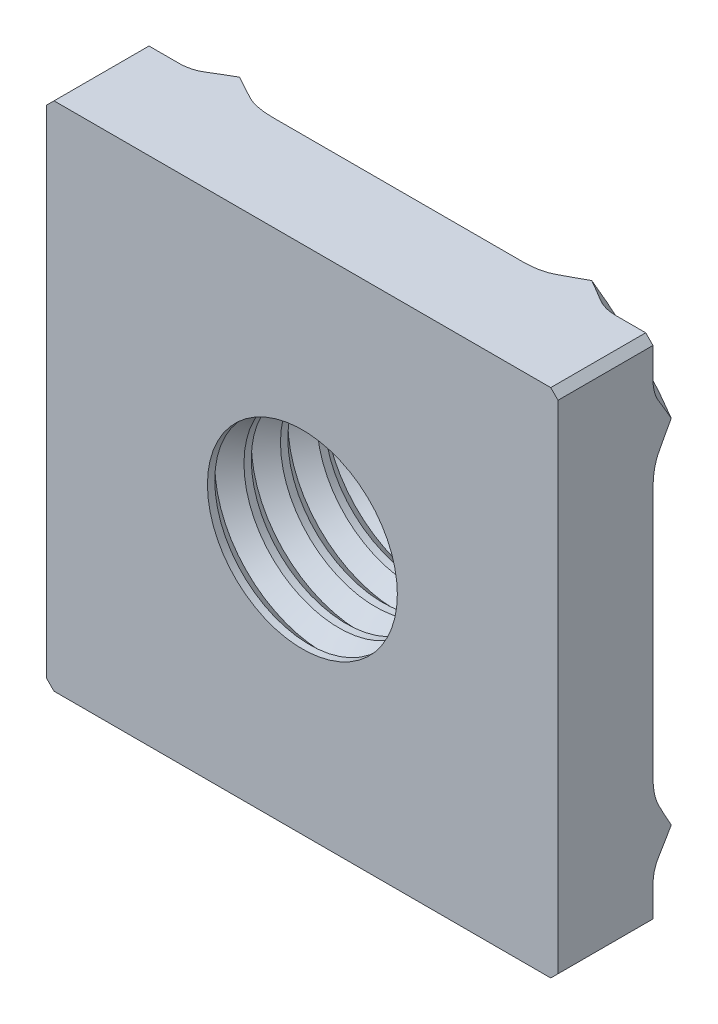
ISO-10303-21;
HEADER;
FILE_DESCRIPTION(('STEP AP214'),'2;1');
FILE_NAME('part.step','',(''),(''),'','','');
FILE_SCHEMA(('AUTOMOTIVE_DESIGN { 1 0 10303 214 1 1 1 1 }'));
ENDSEC;
DATA;
#1=APPLICATION_CONTEXT('core data for automotive mechanical design processes');
#2=APPLICATION_PROTOCOL_DEFINITION('international standard','automotive_design',2000,#1);
#3=PRODUCT_CONTEXT('',#1,'mechanical');
#4=PRODUCT('Part','Part','',(#3));
#5=PRODUCT_RELATED_PRODUCT_CATEGORY('part','',(#4));
#6=PRODUCT_DEFINITION_FORMATION('','',#4);
#7=PRODUCT_DEFINITION_CONTEXT('part definition',#1,'design');
#8=PRODUCT_DEFINITION('design','',#6,#7);
#9=PRODUCT_DEFINITION_SHAPE('','',#8);
#10=(LENGTH_UNIT() NAMED_UNIT(*) SI_UNIT(.MILLI.,.METRE.));
#11=(NAMED_UNIT(*) PLANE_ANGLE_UNIT() SI_UNIT($,.RADIAN.));
#12=(NAMED_UNIT(*) SI_UNIT($,.STERADIAN.) SOLID_ANGLE_UNIT());
#13=UNCERTAINTY_MEASURE_WITH_UNIT(LENGTH_MEASURE(1.E-05),#10,'distance_accuracy_value','');
#14=(GEOMETRIC_REPRESENTATION_CONTEXT(3) GLOBAL_UNCERTAINTY_ASSIGNED_CONTEXT((#13)) GLOBAL_UNIT_ASSIGNED_CONTEXT((#10,
#11,#12)) REPRESENTATION_CONTEXT('',''));
#15=CARTESIAN_POINT('',(0.,0.,0.));
#16=DIRECTION('',(0.,0.,1.));
#17=DIRECTION('',(1.,0.,0.));
#18=AXIS2_PLACEMENT_3D('',#15,#16,#17);
#19=CARTESIAN_POINT('',(7.,-7.,2.9));
#20=DIRECTION('',(0.,0.,1.));
#21=DIRECTION('',(1.,0.,0.));
#22=AXIS2_PLACEMENT_3D('',#19,#20,#21);
#23=PLANE('',#22);
#24=DIRECTION('',(0.,1.,0.));
#25=VECTOR('',#24,1.);
#26=CARTESIAN_POINT('',(7.,7.,2.9));
#27=LINE('',#26,#25);
#28=CARTESIAN_POINT('',(7.,5.98087077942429,2.9));
#29=VERTEX_POINT('',#28);
#30=CARTESIAN_POINT('',(7.,6.8,2.9));
#31=VERTEX_POINT('',#30);
#32=EDGE_CURVE('E273',#29,#31,#27,.T.);
#33=ORIENTED_EDGE('',*,*,#32,.F.);
#34=CARTESIAN_POINT('',(0.,0.,2.9));
#35=DIRECTION('',(0.,0.,1.));
#36=DIRECTION('',(1.,0.,0.));
#37=AXIS2_PLACEMENT_3D('',#34,#35,#36);
#38=CIRCLE('',#37,9.20710678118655);
#39=CARTESIAN_POINT('',(5.98087077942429,7.,2.9));
#40=VERTEX_POINT('',#39);
#41=EDGE_CURVE('E608',#29,#40,#38,.T.);
#42=ORIENTED_EDGE('',*,*,#41,.T.);
#43=DIRECTION('',(-1.,0.,0.));
#44=VECTOR('',#43,1.);
#45=CARTESIAN_POINT('',(-7.,7.,2.9));
#46=LINE('',#45,#44);
#47=CARTESIAN_POINT('',(6.8,7.,2.9));
#48=VERTEX_POINT('',#47);
#49=EDGE_CURVE('E278',#48,#40,#46,.T.);
#50=ORIENTED_EDGE('',*,*,#49,.F.);
#51=DIRECTION('',(-0.707106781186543,0.707106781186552,0.));
#52=VECTOR('',#51,1.);
#53=CARTESIAN_POINT('',(6.8,7.,2.9));
#54=LINE('',#53,#52);
#55=EDGE_CURVE('E787',#48,#31,#54,.F.);
#56=ORIENTED_EDGE('',*,*,#55,.T.);
#57=EDGE_LOOP('',(#33,#42,#50,#56));
#58=FACE_BOUND('',#57,.T.);
#59=ADVANCED_FACE('F17',(#58),#23,.F.);
#60=CARTESIAN_POINT('',(0.,0.,2.9));
#61=DIRECTION('',(0.,0.,1.));
#62=DIRECTION('',(1.,0.,0.));
#63=AXIS2_PLACEMENT_3D('',#60,#61,#62);
#64=CIRCLE('',#63,5.45);
#65=CARTESIAN_POINT('',(5.45,0.,2.9));
#66=VERTEX_POINT('',#65);
#67=EDGE_CURVE('E733',#66,#66,#64,.T.);
#68=ORIENTED_EDGE('',*,*,#67,.T.);
#69=EDGE_LOOP('',(#68));
#70=FACE_BOUND('',#69,.T.);
#71=DIRECTION('',(1.,0.,0.));
#72=VECTOR('',#71,1.);
#73=CARTESIAN_POINT('',(-7.,-7.,2.9));
#74=LINE('',#73,#72);
#75=CARTESIAN_POINT('',(-3.42478973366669,-7.,2.9));
#76=VERTEX_POINT('',#75);
#77=CARTESIAN_POINT('',(3.42478973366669,-7.,2.9));
#78=VERTEX_POINT('',#77);
#79=EDGE_CURVE('E292',#76,#78,#74,.T.);
#80=ORIENTED_EDGE('',*,*,#79,.F.);
#81=CARTESIAN_POINT('',(0.,0.,2.9));
#82=DIRECTION('',(0.,0.,1.));
#83=DIRECTION('',(1.,0.,0.));
#84=AXIS2_PLACEMENT_3D('',#81,#82,#83);
#85=CIRCLE('',#84,7.79289321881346);
#86=CARTESIAN_POINT('',(-7.,-3.42478973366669,2.9));
#87=VERTEX_POINT('',#86);
#88=EDGE_CURVE('E597',#76,#87,#85,.F.);
#89=ORIENTED_EDGE('',*,*,#88,.T.);
#90=DIRECTION('',(0.,-1.,0.));
#91=VECTOR('',#90,1.);
#92=CARTESIAN_POINT('',(-7.,7.,2.9));
#93=LINE('',#92,#91);
#94=CARTESIAN_POINT('',(-7.,3.42478973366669,2.9));
#95=VERTEX_POINT('',#94);
#96=EDGE_CURVE('E287',#95,#87,#93,.T.);
#97=ORIENTED_EDGE('',*,*,#96,.F.);
#98=CARTESIAN_POINT('',(0.,0.,2.9));
#99=DIRECTION('',(0.,0.,1.));
#100=DIRECTION('',(1.,0.,0.));
#101=AXIS2_PLACEMENT_3D('',#98,#99,#100);
#102=CIRCLE('',#101,7.79289321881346);
#103=CARTESIAN_POINT('',(-3.42478973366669,7.,2.9));
#104=VERTEX_POINT('',#103);
#105=EDGE_CURVE('E746',#95,#104,#102,.F.);
#106=ORIENTED_EDGE('',*,*,#105,.T.);
#107=CARTESIAN_POINT('',(3.42478973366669,7.,2.9));
#108=VERTEX_POINT('',#107);
#109=EDGE_CURVE('E282',#108,#104,#46,.T.);
#110=ORIENTED_EDGE('',*,*,#109,.F.);
#111=CARTESIAN_POINT('',(0.,0.,2.9));
#112=DIRECTION('',(0.,0.,1.));
#113=DIRECTION('',(1.,0.,0.));
#114=AXIS2_PLACEMENT_3D('',#111,#112,#113);
#115=CIRCLE('',#114,7.79289321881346);
#116=CARTESIAN_POINT('',(7.,3.42478973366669,2.9));
#117=VERTEX_POINT('',#116);
#118=EDGE_CURVE('E744',#108,#117,#115,.F.);
#119=ORIENTED_EDGE('',*,*,#118,.T.);
#120=CARTESIAN_POINT('',(7.,-3.42478973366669,2.9));
#121=VERTEX_POINT('',#120);
#122=EDGE_CURVE('E277',#121,#117,#27,.T.);
#123=ORIENTED_EDGE('',*,*,#122,.F.);
#124=CARTESIAN_POINT('',(0.,0.,2.9));
#125=DIRECTION('',(0.,0.,1.));
#126=DIRECTION('',(1.,0.,0.));
#127=AXIS2_PLACEMENT_3D('',#124,#125,#126);
#128=CIRCLE('',#127,7.79289321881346);
#129=EDGE_CURVE('E736',#121,#78,#128,.F.);
#130=ORIENTED_EDGE('',*,*,#129,.T.);
#131=EDGE_LOOP('',(#80,#89,#97,#106,#110,#119,#123,#130));
#132=FACE_BOUND('',#131,.T.);
#133=ADVANCED_FACE('F559',(#70,#132),#23,.F.);
#134=CARTESIAN_POINT('',(5.98087077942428,-7.,2.9));
#135=VERTEX_POINT('',#134);
#136=CARTESIAN_POINT('',(6.8,-7.,2.9));
#137=VERTEX_POINT('',#136);
#138=EDGE_CURVE('E286',#135,#137,#74,.T.);
#139=ORIENTED_EDGE('',*,*,#138,.F.);
#140=CARTESIAN_POINT('',(0.,0.,2.9));
#141=DIRECTION('',(0.,0.,1.));
#142=DIRECTION('',(1.,0.,0.));
#143=AXIS2_PLACEMENT_3D('',#140,#141,#142);
#144=CIRCLE('',#143,9.20710678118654);
#145=CARTESIAN_POINT('',(7.,-5.98087077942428,2.9));
#146=VERTEX_POINT('',#145);
#147=EDGE_CURVE('E43',#135,#146,#144,.T.);
#148=ORIENTED_EDGE('',*,*,#147,.T.);
#149=CARTESIAN_POINT('',(7.,-6.8,2.9));
#150=VERTEX_POINT('',#149);
#151=EDGE_CURVE('E274',#150,#146,#27,.T.);
#152=ORIENTED_EDGE('',*,*,#151,.F.);
#153=DIRECTION('',(0.707106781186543,0.707106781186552,0.));
#154=VECTOR('',#153,1.);
#155=CARTESIAN_POINT('',(7.,-6.8,2.9));
#156=LINE('',#155,#154);
#157=EDGE_CURVE('E739',#150,#137,#156,.F.);
#158=ORIENTED_EDGE('',*,*,#157,.T.);
#159=EDGE_LOOP('',(#139,#148,#152,#158));
#160=FACE_BOUND('',#159,.T.);
#161=ADVANCED_FACE('F566',(#160),#23,.F.);
#162=CARTESIAN_POINT('',(-5.98087077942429,7.,2.9));
#163=VERTEX_POINT('',#162);
#164=CARTESIAN_POINT('',(-6.8,7.,2.9));
#165=VERTEX_POINT('',#164);
#166=EDGE_CURVE('E276',#163,#165,#46,.T.);
#167=ORIENTED_EDGE('',*,*,#166,.F.);
#168=CARTESIAN_POINT('',(0.,0.,2.9));
#169=DIRECTION('',(0.,0.,1.));
#170=DIRECTION('',(1.,0.,0.));
#171=AXIS2_PLACEMENT_3D('',#168,#169,#170);
#172=CIRCLE('',#171,9.20710678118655);
#173=CARTESIAN_POINT('',(-7.,5.98087077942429,2.9));
#174=VERTEX_POINT('',#173);
#175=EDGE_CURVE('E603',#163,#174,#172,.T.);
#176=ORIENTED_EDGE('',*,*,#175,.T.);
#177=CARTESIAN_POINT('',(-7.,6.8,2.9));
#178=VERTEX_POINT('',#177);
#179=EDGE_CURVE('E283',#178,#174,#93,.T.);
#180=ORIENTED_EDGE('',*,*,#179,.F.);
#181=DIRECTION('',(-0.707106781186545,-0.707106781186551,0.));
#182=VECTOR('',#181,1.);
#183=CARTESIAN_POINT('',(-7.,6.8,2.9));
#184=LINE('',#183,#182);
#185=EDGE_CURVE('E763',#178,#165,#184,.F.);
#186=ORIENTED_EDGE('',*,*,#185,.T.);
#187=EDGE_LOOP('',(#167,#176,#180,#186));
#188=FACE_BOUND('',#187,.T.);
#189=ADVANCED_FACE('F571',(#188),#23,.F.);
#190=CARTESIAN_POINT('',(-7.,-5.98087077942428,2.9));
#191=VERTEX_POINT('',#190);
#192=CARTESIAN_POINT('',(-7.,-6.8,2.9));
#193=VERTEX_POINT('',#192);
#194=EDGE_CURVE('E281',#191,#193,#93,.T.);
#195=ORIENTED_EDGE('',*,*,#194,.F.);
#196=CARTESIAN_POINT('',(0.,0.,2.9));
#197=DIRECTION('',(0.,0.,1.));
#198=DIRECTION('',(1.,0.,0.));
#199=AXIS2_PLACEMENT_3D('',#196,#197,#198);
#200=CIRCLE('',#199,9.20710678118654);
#201=CARTESIAN_POINT('',(-5.98087077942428,-7.,2.9));
#202=VERTEX_POINT('',#201);
#203=EDGE_CURVE('E585',#191,#202,#200,.T.);
#204=ORIENTED_EDGE('',*,*,#203,.T.);
#205=CARTESIAN_POINT('',(-6.8,-7.,2.9));
#206=VERTEX_POINT('',#205);
#207=EDGE_CURVE('E288',#206,#202,#74,.T.);
#208=ORIENTED_EDGE('',*,*,#207,.F.);
#209=DIRECTION('',(0.707106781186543,-0.707106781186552,0.));
#210=VECTOR('',#209,1.);
#211=CARTESIAN_POINT('',(-6.8,-7.,2.9));
#212=LINE('',#211,#210);
#213=EDGE_CURVE('E586',#206,#193,#212,.F.);
#214=ORIENTED_EDGE('',*,*,#213,.T.);
#215=EDGE_LOOP('',(#195,#204,#208,#214));
#216=FACE_BOUND('',#215,.T.);
#217=ADVANCED_FACE('F561',(#216),#23,.F.);
#218=CARTESIAN_POINT('',(0.,0.,2.9));
#219=DIRECTION('',(0.,0.,-1.));
#220=DIRECTION('',(-1.,0.,0.));
#221=AXIS2_PLACEMENT_3D('',#218,#219,#220);
#222=CYLINDRICAL_SURFACE('',#221,2.6);
#223=CARTESIAN_POINT('',(0.,0.,4.5));
#224=DIRECTION('',(0.,0.,1.));
#225=DIRECTION('',(1.,0.,0.));
#226=AXIS2_PLACEMENT_3D('',#223,#224,#225);
#227=CIRCLE('',#226,2.6);
#228=CARTESIAN_POINT('',(2.6,0.,4.5));
#229=VERTEX_POINT('',#228);
#230=EDGE_CURVE('E250',#229,#229,#227,.F.);
#231=ORIENTED_EDGE('',*,*,#230,.F.);
#232=EDGE_LOOP('',(#231));
#233=FACE_BOUND('',#232,.T.);
#234=CARTESIAN_POINT('',(0.,0.,4.3));
#235=DIRECTION('',(0.,0.,-1.));
#236=DIRECTION('',(-1.,0.,0.));
#237=AXIS2_PLACEMENT_3D('',#234,#235,#236);
#238=CIRCLE('',#237,2.6);
#239=CARTESIAN_POINT('',(-2.6,0.,4.3));
#240=VERTEX_POINT('',#239);
#241=EDGE_CURVE('E249',#240,#240,#238,.F.);
#242=ORIENTED_EDGE('',*,*,#241,.F.);
#243=EDGE_LOOP('',(#242));
#244=FACE_BOUND('',#243,.T.);
#245=ADVANCED_FACE('F570',(#233,#244),#222,.F.);
#246=CARTESIAN_POINT('',(0.,0.,3.5));
#247=DIRECTION('',(0.,0.,1.));
#248=DIRECTION('',(1.,0.,0.));
#249=AXIS2_PLACEMENT_3D('',#246,#247,#248);
#250=CIRCLE('',#249,2.6);
#251=CARTESIAN_POINT('',(2.6,0.,3.5));
#252=VERTEX_POINT('',#251);
#253=EDGE_CURVE('E255',#252,#252,#250,.F.);
#254=ORIENTED_EDGE('',*,*,#253,.F.);
#255=EDGE_LOOP('',(#254));
#256=FACE_BOUND('',#255,.T.);
#257=CARTESIAN_POINT('',(0.,0.,3.3));
#258=DIRECTION('',(0.,0.,-1.));
#259=DIRECTION('',(-1.,0.,0.));
#260=AXIS2_PLACEMENT_3D('',#257,#258,#259);
#261=CIRCLE('',#260,2.6);
#262=CARTESIAN_POINT('',(-2.6,0.,3.3));
#263=VERTEX_POINT('',#262);
#264=EDGE_CURVE('E254',#263,#263,#261,.F.);
#265=ORIENTED_EDGE('',*,*,#264,.F.);
#266=EDGE_LOOP('',(#265));
#267=FACE_BOUND('',#266,.T.);
#268=ADVANCED_FACE('F578',(#256,#267),#222,.F.);
#269=CARTESIAN_POINT('',(0.,0.,2.5));
#270=DIRECTION('',(0.,0.,1.));
#271=DIRECTION('',(1.,0.,0.));
#272=AXIS2_PLACEMENT_3D('',#269,#270,#271);
#273=CIRCLE('',#272,2.6);
#274=CARTESIAN_POINT('',(2.6,0.,2.5));
#275=VERTEX_POINT('',#274);
#276=EDGE_CURVE('E260',#275,#275,#273,.F.);
#277=ORIENTED_EDGE('',*,*,#276,.F.);
#278=EDGE_LOOP('',(#277));
#279=FACE_BOUND('',#278,.T.);
#280=CARTESIAN_POINT('',(0.,0.,2.3));
#281=DIRECTION('',(0.,0.,-1.));
#282=DIRECTION('',(-1.,0.,0.));
#283=AXIS2_PLACEMENT_3D('',#280,#281,#282);
#284=CIRCLE('',#283,2.6);
#285=CARTESIAN_POINT('',(-2.6,0.,2.3));
#286=VERTEX_POINT('',#285);
#287=EDGE_CURVE('E259',#286,#286,#284,.F.);
#288=ORIENTED_EDGE('',*,*,#287,.F.);
#289=EDGE_LOOP('',(#288));
#290=FACE_BOUND('',#289,.T.);
#291=ADVANCED_FACE('F1012',(#279,#290),#222,.F.);
#292=CARTESIAN_POINT('',(0.,0.,1.5));
#293=DIRECTION('',(0.,0.,1.));
#294=DIRECTION('',(1.,0.,0.));
#295=AXIS2_PLACEMENT_3D('',#292,#293,#294);
#296=CIRCLE('',#295,2.6);
#297=CARTESIAN_POINT('',(2.6,0.,1.5));
#298=VERTEX_POINT('',#297);
#299=EDGE_CURVE('E265',#298,#298,#296,.F.);
#300=ORIENTED_EDGE('',*,*,#299,.F.);
#301=EDGE_LOOP('',(#300));
#302=FACE_BOUND('',#301,.T.);
#303=CARTESIAN_POINT('',(0.,0.,1.3));
#304=DIRECTION('',(0.,0.,-1.));
#305=DIRECTION('',(-1.,0.,0.));
#306=AXIS2_PLACEMENT_3D('',#303,#304,#305);
#307=CIRCLE('',#306,2.6);
#308=CARTESIAN_POINT('',(-2.6,0.,1.3));
#309=VERTEX_POINT('',#308);
#310=EDGE_CURVE('E264',#309,#309,#307,.F.);
#311=ORIENTED_EDGE('',*,*,#310,.F.);
#312=EDGE_LOOP('',(#311));
#313=FACE_BOUND('',#312,.T.);
#314=ADVANCED_FACE('F1019',(#302,#313),#222,.F.);
#315=CARTESIAN_POINT('',(0.,0.,0.5));
#316=DIRECTION('',(0.,0.,1.));
#317=DIRECTION('',(1.,0.,0.));
#318=AXIS2_PLACEMENT_3D('',#315,#316,#317);
#319=CIRCLE('',#318,2.6);
#320=CARTESIAN_POINT('',(2.6,0.,0.5));
#321=VERTEX_POINT('',#320);
#322=EDGE_CURVE('E308',#321,#321,#319,.F.);
#323=ORIENTED_EDGE('',*,*,#322,.F.);
#324=EDGE_LOOP('',(#323));
#325=FACE_BOUND('',#324,.T.);
#326=CARTESIAN_POINT('',(0.,0.,0.3));
#327=DIRECTION('',(0.,0.,-1.));
#328=DIRECTION('',(-1.,0.,0.));
#329=AXIS2_PLACEMENT_3D('',#326,#327,#328);
#330=CIRCLE('',#329,2.6);
#331=CARTESIAN_POINT('',(-2.6,0.,0.3));
#332=VERTEX_POINT('',#331);
#333=EDGE_CURVE('E270',#332,#332,#330,.F.);
#334=ORIENTED_EDGE('',*,*,#333,.F.);
#335=EDGE_LOOP('',(#334));
#336=FACE_BOUND('',#335,.T.);
#337=ADVANCED_FACE('F719',(#325,#336),#222,.F.);
#338=CARTESIAN_POINT('',(0.,0.,0.));
#339=DIRECTION('',(0.,0.,1.));
#340=DIRECTION('',(1.,0.,0.));
#341=AXIS2_PLACEMENT_3D('',#338,#339,#340);
#342=PLANE('',#341);
#343=CARTESIAN_POINT('',(0.,0.,0.));
#344=DIRECTION('',(0.,0.,1.));
#345=DIRECTION('',(1.,0.,0.));
#346=AXIS2_PLACEMENT_3D('',#343,#344,#345);
#347=CIRCLE('',#346,2.9);
#348=CARTESIAN_POINT('',(2.9,0.,0.));
#349=VERTEX_POINT('',#348);
#350=EDGE_CURVE('E266',#349,#349,#347,.T.);
#351=ORIENTED_EDGE('',*,*,#350,.T.);
#352=EDGE_LOOP('',(#351));
#353=FACE_BOUND('',#352,.T.);
#354=CARTESIAN_POINT('',(0.,0.,0.));
#355=DIRECTION('',(0.,0.,1.));
#356=DIRECTION('',(1.,0.,0.));
#357=AXIS2_PLACEMENT_3D('',#354,#355,#356);
#358=CIRCLE('',#357,3.95);
#359=CARTESIAN_POINT('',(3.95,0.,0.));
#360=VERTEX_POINT('',#359);
#361=EDGE_CURVE('E227',#360,#360,#358,.T.);
#362=ORIENTED_EDGE('',*,*,#361,.F.);
#363=EDGE_LOOP('',(#362));
#364=FACE_BOUND('',#363,.T.);
#365=ADVANCED_FACE('F716',(#353,#364),#342,.F.);
#366=CARTESIAN_POINT('',(0.,0.,2.9));
#367=DIRECTION('',(0.,0.,-1.));
#368=DIRECTION('',(-1.,0.,0.));
#369=AXIS2_PLACEMENT_3D('',#366,#367,#368);
#370=CYLINDRICAL_SURFACE('',#369,3.95);
#371=CARTESIAN_POINT('',(0.,0.,1.4));
#372=DIRECTION('',(0.,0.,1.));
#373=DIRECTION('',(1.,0.,0.));
#374=AXIS2_PLACEMENT_3D('',#371,#372,#373);
#375=CIRCLE('',#374,3.95);
#376=CARTESIAN_POINT('',(3.95,0.,1.4));
#377=VERTEX_POINT('',#376);
#378=EDGE_CURVE('E731',#377,#377,#375,.F.);
#379=ORIENTED_EDGE('',*,*,#378,.T.);
#380=EDGE_LOOP('',(#379));
#381=FACE_BOUND('',#380,.T.);
#382=ORIENTED_EDGE('',*,*,#361,.T.);
#383=EDGE_LOOP('',(#382));
#384=FACE_BOUND('',#383,.T.);
#385=ADVANCED_FACE('F19',(#381,#384),#370,.T.);
#386=CARTESIAN_POINT('',(0.,0.,5.3));
#387=DIRECTION('',(0.,0.,-1.));
#388=DIRECTION('',(-1.,0.,0.));
#389=AXIS2_PLACEMENT_3D('',#386,#387,#388);
#390=CIRCLE('',#389,2.6);
#391=CARTESIAN_POINT('',(-2.6,0.,5.3));
#392=VERTEX_POINT('',#391);
#393=EDGE_CURVE('E245',#392,#392,#390,.F.);
#394=ORIENTED_EDGE('',*,*,#393,.F.);
#395=EDGE_LOOP('',(#394));
#396=FACE_BOUND('',#395,.T.);
#397=CARTESIAN_POINT('',(0.,0.,5.5));
#398=DIRECTION('',(0.,0.,1.));
#399=DIRECTION('',(1.,0.,0.));
#400=AXIS2_PLACEMENT_3D('',#397,#398,#399);
#401=CIRCLE('',#400,2.6);
#402=CARTESIAN_POINT('',(2.6,0.,5.5));
#403=VERTEX_POINT('',#402);
#404=EDGE_CURVE('E269',#403,#403,#401,.T.);
#405=ORIENTED_EDGE('',*,*,#404,.T.);
#406=EDGE_LOOP('',(#405));
#407=FACE_BOUND('',#406,.T.);
#408=ADVANCED_FACE('F347',(#396,#407),#222,.F.);
#409=CARTESIAN_POINT('',(7.,-7.,5.5));
#410=DIRECTION('',(0.,0.,1.));
#411=DIRECTION('',(1.,0.,0.));
#412=AXIS2_PLACEMENT_3D('',#409,#410,#411);
#413=PLANE('',#412);
#414=DIRECTION('',(-1.,0.,0.));
#415=VECTOR('',#414,1.);
#416=CARTESIAN_POINT('',(-7.,7.,5.5));
#417=LINE('',#416,#415);
#418=CARTESIAN_POINT('',(6.8,7.,5.5));
#419=VERTEX_POINT('',#418);
#420=CARTESIAN_POINT('',(-6.8,7.,5.5));
#421=VERTEX_POINT('',#420);
#422=EDGE_CURVE('E295',#419,#421,#417,.T.);
#423=ORIENTED_EDGE('',*,*,#422,.T.);
#424=DIRECTION('',(0.707106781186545,0.707106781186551,0.));
#425=VECTOR('',#424,1.);
#426=CARTESIAN_POINT('',(-6.9,6.9,5.5));
#427=LINE('',#426,#425);
#428=CARTESIAN_POINT('',(-7.,6.8,5.5));
#429=VERTEX_POINT('',#428);
#430=EDGE_CURVE('E779',#421,#429,#427,.F.);
#431=ORIENTED_EDGE('',*,*,#430,.T.);
#432=DIRECTION('',(0.,-1.,0.));
#433=VECTOR('',#432,1.);
#434=CARTESIAN_POINT('',(-7.,7.,5.5));
#435=LINE('',#434,#433);
#436=CARTESIAN_POINT('',(-7.,-6.8,5.5));
#437=VERTEX_POINT('',#436);
#438=EDGE_CURVE('E298',#429,#437,#435,.T.);
#439=ORIENTED_EDGE('',*,*,#438,.T.);
#440=DIRECTION('',(-0.707106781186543,0.707106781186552,0.));
#441=VECTOR('',#440,1.);
#442=CARTESIAN_POINT('',(0.0999999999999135,-13.9,5.5));
#443=LINE('',#442,#441);
#444=CARTESIAN_POINT('',(-6.8,-7.,5.5));
#445=VERTEX_POINT('',#444);
#446=EDGE_CURVE('E777',#437,#445,#443,.F.);
#447=ORIENTED_EDGE('',*,*,#446,.T.);
#448=DIRECTION('',(1.,0.,0.));
#449=VECTOR('',#448,1.);
#450=CARTESIAN_POINT('',(-7.,-7.,5.5));
#451=LINE('',#450,#449);
#452=CARTESIAN_POINT('',(6.8,-7.,5.5));
#453=VERTEX_POINT('',#452);
#454=EDGE_CURVE('E301',#445,#453,#451,.T.);
#455=ORIENTED_EDGE('',*,*,#454,.T.);
#456=DIRECTION('',(-0.707106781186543,-0.707106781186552,0.));
#457=VECTOR('',#456,1.);
#458=CARTESIAN_POINT('',(6.9,-6.9,5.5));
#459=LINE('',#458,#457);
#460=CARTESIAN_POINT('',(7.,-6.8,5.5));
#461=VERTEX_POINT('',#460);
#462=EDGE_CURVE('E773',#453,#461,#459,.F.);
#463=ORIENTED_EDGE('',*,*,#462,.T.);
#464=DIRECTION('',(0.,1.,0.));
#465=VECTOR('',#464,1.);
#466=CARTESIAN_POINT('',(7.,7.,5.5));
#467=LINE('',#466,#465);
#468=CARTESIAN_POINT('',(7.,6.8,5.5));
#469=VERTEX_POINT('',#468);
#470=EDGE_CURVE('E291',#461,#469,#467,.T.);
#471=ORIENTED_EDGE('',*,*,#470,.T.);
#472=DIRECTION('',(0.707106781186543,-0.707106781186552,0.));
#473=VECTOR('',#472,1.);
#474=CARTESIAN_POINT('',(13.9,-0.100000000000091,5.5));
#475=LINE('',#474,#473);
#476=EDGE_CURVE('E775',#469,#419,#475,.F.);
#477=ORIENTED_EDGE('',*,*,#476,.T.);
#478=EDGE_LOOP('',(#423,#431,#439,#447,#455,#463,#471,#477));
#479=FACE_BOUND('',#478,.T.);
#480=ORIENTED_EDGE('',*,*,#404,.F.);
#481=EDGE_LOOP('',(#480));
#482=FACE_BOUND('',#481,.T.);
#483=ADVANCED_FACE('F344',(#479,#482),#413,.T.);
#484=CARTESIAN_POINT('',(7.,7.,5.5));
#485=DIRECTION('',(-1.,0.,0.));
#486=DIRECTION('',(0.,-1.,0.));
#487=AXIS2_PLACEMENT_3D('',#484,#485,#486);
#488=PLANE('',#487);
#489=CARTESIAN_POINT('',(7.,4.82182538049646,2.4));
#490=CARTESIAN_POINT('',(7.,4.89238250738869,2.44002602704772));
#491=CARTESIAN_POINT('',(7.,4.96268396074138,2.48050116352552));
#492=CARTESIAN_POINT('',(7.,5.10278771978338,2.56228631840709));
#493=CARTESIAN_POINT('',(7.,5.17259008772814,2.60359623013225));
#494=CARTESIAN_POINT('',(7.,5.31172500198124,2.68699732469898));
#495=CARTESIAN_POINT('',(7.,5.38105755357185,2.72908849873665));
#496=CARTESIAN_POINT('',(7.,5.51928288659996,2.81400654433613));
#497=CARTESIAN_POINT('',(7.,5.58817561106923,2.85683350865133));
#498=CARTESIAN_POINT('',(7.,5.65685424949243,2.89999999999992));
#499=B_SPLINE_CURVE_WITH_KNOTS('',3,(#489,#490,#491,#492,#493,#494,#495,#496,#497,#498),
.UNSPECIFIED.,.F.,.F.,(4,2,2,2,4),(0.,0.243356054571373,0.48668120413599,0.730003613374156,
0.973356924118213),.UNSPECIFIED.);
#500=CARTESIAN_POINT('',(7.,4.82182538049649,2.4));
#501=VERTEX_POINT('',#500);
#502=CARTESIAN_POINT('',(7.,5.42083089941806,2.75355339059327));
#503=VERTEX_POINT('',#502);
#504=EDGE_CURVE('E359',#501,#503,#499,.T.);
#505=ORIENTED_EDGE('',*,*,#504,.T.);
#506=CARTESIAN_POINT('',(7.,5.42083089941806,2.75355339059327));
#507=CARTESIAN_POINT('',(7.,5.44384160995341,2.76762090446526));
#508=CARTESIAN_POINT('',(7.,5.46753181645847,2.7805224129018));
#509=CARTESIAN_POINT('',(7.,5.51594143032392,2.80413818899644));
#510=CARTESIAN_POINT('',(7.,5.54065933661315,2.81485552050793));
#511=CARTESIAN_POINT('',(7.,5.59039346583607,2.83410548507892));
#512=CARTESIAN_POINT('',(7.,5.61539554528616,2.8426751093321));
#513=CARTESIAN_POINT('',(7.,5.66595927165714,2.85798151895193));
#514=CARTESIAN_POINT('',(7.,5.69152110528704,2.86471768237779));
#515=CARTESIAN_POINT('',(7.,5.76013073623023,2.88030922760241));
#516=CARTESIAN_POINT('',(7.,5.80353840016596,2.88760983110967));
#517=CARTESIAN_POINT('',(7.,5.89159074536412,2.89747600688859));
#518=CARTESIAN_POINT('',(7.,5.93624412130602,2.89996444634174));
#519=CARTESIAN_POINT('',(7.,5.98087077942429,2.9));
#520=B_SPLINE_CURVE_WITH_KNOTS('',3,(#506,#507,#508,#509,#510,#511,#512,#513,#514,#515,#516,
#517,#518,#519),.UNSPECIFIED.,.F.,.F.,(4,2,2,2,2,2,4),(0.,0.0808352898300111,0.161556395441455,
0.240773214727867,0.320016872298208,0.451785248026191,0.585648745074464),.UNSPECIFIED.);
#521=EDGE_CURVE('E367',#503,#29,#520,.T.);
#522=ORIENTED_EDGE('',*,*,#521,.T.);
#523=ORIENTED_EDGE('',*,*,#32,.T.);
#524=DIRECTION('',(0.,0.,1.));
#525=VECTOR('',#524,1.);
#526=CARTESIAN_POINT('',(7.,6.8,5.5));
#527=LINE('',#526,#525);
#528=EDGE_CURVE('E793',#31,#469,#527,.T.);
#529=ORIENTED_EDGE('',*,*,#528,.T.);
#530=ORIENTED_EDGE('',*,*,#470,.F.);
#531=DIRECTION('',(0.,0.,-1.));
#532=VECTOR('',#531,1.);
#533=CARTESIAN_POINT('',(7.,-6.8,5.5));
#534=LINE('',#533,#532);
#535=EDGE_CURVE('E790',#461,#150,#534,.T.);
#536=ORIENTED_EDGE('',*,*,#535,.T.);
#537=ORIENTED_EDGE('',*,*,#151,.T.);
#538=CARTESIAN_POINT('',(7.,-5.98087077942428,2.9));
#539=CARTESIAN_POINT('',(7.,-5.94695654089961,2.8999878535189));
#540=CARTESIAN_POINT('',(7.,-5.91304129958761,2.89854337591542));
#541=CARTESIAN_POINT('',(7.,-5.84540329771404,2.89278514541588));
#542=CARTESIAN_POINT('',(7.,-5.81168091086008,2.88846700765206));
#543=CARTESIAN_POINT('',(7.,-5.7455764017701,2.87710266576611));
#544=CARTESIAN_POINT('',(7.,-5.71318196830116,2.87012834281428));
#545=CARTESIAN_POINT('',(7.,-5.64915328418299,2.85336682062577));
#546=CARTESIAN_POINT('',(7.,-5.61751840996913,2.84358202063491));
#547=CARTESIAN_POINT('',(7.,-5.55780475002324,2.82194166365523));
#548=CARTESIAN_POINT('',(7.,-5.52964412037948,2.81031482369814));
#549=CARTESIAN_POINT('',(7.,-5.47429822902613,2.78417010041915));
#550=CARTESIAN_POINT('',(7.,-5.44712839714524,2.76961972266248));
#551=CARTESIAN_POINT('',(7.,-5.42083089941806,2.75355339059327));
#552=B_SPLINE_CURVE_WITH_KNOTS('',3,(#538,#539,#540,#541,#542,#543,#544,#545,#546,#547,#548,
#549,#550,#551),.UNSPECIFIED.,.F.,.F.,(4,2,2,2,2,2,4),(0.,0.101714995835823,0.203585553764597,
0.302875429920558,0.402080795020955,0.493337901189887,0.585671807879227),.UNSPECIFIED.);
#553=CARTESIAN_POINT('',(7.,-5.42083089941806,2.75355339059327));
#554=VERTEX_POINT('',#553);
#555=EDGE_CURVE('E11',#146,#554,#552,.T.);
#556=ORIENTED_EDGE('',*,*,#555,.T.);
#557=CARTESIAN_POINT('',(7.,-5.65685424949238,2.9));
#558=CARTESIAN_POINT('',(7.,-5.5881756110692,2.85683350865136));
#559=CARTESIAN_POINT('',(7.,-5.51928288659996,2.81400654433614));
#560=CARTESIAN_POINT('',(7.,-5.38105755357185,2.72908849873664));
#561=CARTESIAN_POINT('',(7.,-5.31172500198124,2.68699732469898));
#562=CARTESIAN_POINT('',(7.,-5.17259008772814,2.60359623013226));
#563=CARTESIAN_POINT('',(7.,-5.10278771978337,2.56228631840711));
#564=CARTESIAN_POINT('',(7.,-4.9626839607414,2.4805011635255));
#565=CARTESIAN_POINT('',(7.,-4.89238250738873,2.44002602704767));
#566=CARTESIAN_POINT('',(7.,-4.82182538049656,2.39999999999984));
#567=B_SPLINE_CURVE_WITH_KNOTS('',3,(#557,#558,#559,#560,#561,#562,#563,#564,#565,#566),
.UNSPECIFIED.,.F.,.F.,(4,2,2,2,4),(0.,0.243353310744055,0.486675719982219,0.730000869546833,
0.9733569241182),.UNSPECIFIED.);
#568=CARTESIAN_POINT('',(7.,-4.82182538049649,2.4));
#569=VERTEX_POINT('',#568);
#570=EDGE_CURVE('E206',#554,#569,#567,.T.);
#571=ORIENTED_EDGE('',*,*,#570,.T.);
#572=CARTESIAN_POINT('',(7.,-4.82182538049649,2.4));
#573=CARTESIAN_POINT('',(7.,-4.74406313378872,2.44411115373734));
#574=CARTESIAN_POINT('',(7.,-4.66599013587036,2.48767749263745));
#575=CARTESIAN_POINT('',(7.,-4.50921520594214,2.57361308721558));
#576=CARTESIAN_POINT('',(7.,-4.43051344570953,2.61598265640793));
#577=CARTESIAN_POINT('',(7.,-4.2724304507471,2.69944175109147));
#578=CARTESIAN_POINT('',(7.,-4.19304919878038,2.7405312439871));
#579=CARTESIAN_POINT('',(7.,-4.0335616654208,2.82133073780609));
#580=CARTESIAN_POINT('',(7.,-3.95345519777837,2.86104037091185));
#581=CARTESIAN_POINT('',(7.,-3.87298334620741,2.9));
#582=B_SPLINE_CURVE_WITH_KNOTS('',3,(#572,#573,#574,#575,#576,#577,#578,#579,#580,#581),
.UNSPECIFIED.,.F.,.F.,(4,2,2,2,4),(0.,0.268206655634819,0.536342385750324,0.804484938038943,
1.07269842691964),.UNSPECIFIED.);
#583=CARTESIAN_POINT('',(7.,-4.16708439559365,2.75355339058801));
#584=VERTEX_POINT('',#583);
#585=EDGE_CURVE('E210',#569,#584,#582,.T.);
#586=ORIENTED_EDGE('',*,*,#585,.T.);
#587=CARTESIAN_POINT('',(6.99999999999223,-4.16708439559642,2.75355339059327));
#588=CARTESIAN_POINT('',(6.99999999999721,-4.13781018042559,2.76848698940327));
#589=CARTESIAN_POINT('',(6.99999999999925,-4.10780304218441,2.78186487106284));
#590=CARTESIAN_POINT('',(7.00000000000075,-4.04678621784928,2.80589472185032));
#591=CARTESIAN_POINT('',(7.0000000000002,-4.01577893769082,2.81655275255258));
#592=CARTESIAN_POINT('',(6.9999999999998,-3.95348504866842,2.83547186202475));
#593=CARTESIAN_POINT('',(6.99999999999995,-3.92220688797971,2.84376146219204));
#594=CARTESIAN_POINT('',(7.00000000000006,-3.85918638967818,2.85840198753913));
#595=CARTESIAN_POINT('',(7.00000000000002,-3.82744377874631,2.86475171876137));
#596=CARTESIAN_POINT('',(6.99999999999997,-3.73476553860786,2.88071736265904));
#597=CARTESIAN_POINT('',(6.99999999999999,-3.67343459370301,2.8880809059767));
#598=CARTESIAN_POINT('',(7.,-3.58080436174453,2.89531936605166));
#599=CARTESIAN_POINT('',(7.,-3.5496270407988,2.8970966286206));
#600=CARTESIAN_POINT('',(7.,-3.48723110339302,2.89943561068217));
#601=CARTESIAN_POINT('',(7.,-3.45601249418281,2.89999752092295));
#602=CARTESIAN_POINT('',(7.,-3.42478973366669,2.9));
#603=B_SPLINE_CURVE_WITH_KNOTS('',3,(#587,#588,#589,#590,#591,#592,#593,#594,#595,#596,#597,
#598,#599,#600,#601,#602),.UNSPECIFIED.,.F.,.F.,(4,2,2,2,2,2,2,4),(0.,0.0984666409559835,
0.196711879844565,0.293718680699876,0.390785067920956,0.575787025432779,0.669454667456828,
0.763107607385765),.UNSPECIFIED.);
#604=EDGE_CURVE('E382',#584,#121,#603,.T.);
#605=ORIENTED_EDGE('',*,*,#604,.T.);
#606=ORIENTED_EDGE('',*,*,#122,.T.);
#607=CARTESIAN_POINT('',(7.,3.42478973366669,2.9));
#608=CARTESIAN_POINT('',(7.,3.45337635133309,2.89999814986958));
#609=CARTESIAN_POINT('',(7.,3.48196090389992,2.89952673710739));
#610=CARTESIAN_POINT('',(7.,3.539106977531,2.89757172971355));
#611=CARTESIAN_POINT('',(7.,3.56766848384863,2.89608770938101));
#612=CARTESIAN_POINT('',(7.,3.65373947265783,2.88997311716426));
#613=CARTESIAN_POINT('',(7.,3.7111476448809,2.88367740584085));
#614=CARTESIAN_POINT('',(7.,3.82333497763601,2.86610704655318));
#615=CARTESIAN_POINT('',(7.,3.87813963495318,2.85499736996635));
#616=CARTESIAN_POINT('',(7.,3.98604454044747,2.82671970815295));
#617=CARTESIAN_POINT('',(7.,4.03915075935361,2.80957627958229));
#618=CARTESIAN_POINT('',(7.,4.1035882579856,2.78323409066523));
#619=CARTESIAN_POINT('',(7.,4.11643520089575,2.77769339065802));
#620=CARTESIAN_POINT('',(7.,4.14193179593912,2.76605199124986));
#621=CARTESIAN_POINT('',(7.,4.15458050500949,2.75994923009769));
#622=CARTESIAN_POINT('',(7.,4.16708439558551,2.75355339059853));
#623=B_SPLINE_CURVE_WITH_KNOTS('',3,(#607,#608,#609,#610,#611,#612,#613,#614,#615,#616,#617,
#618,#619,#620,#621,#622),.UNSPECIFIED.,.F.,.F.,(4,2,2,2,2,2,2,4),(0.,0.0857504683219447,
0.171537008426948,0.344570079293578,0.512091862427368,0.678939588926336,0.720901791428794,
0.763024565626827),.UNSPECIFIED.);
#624=CARTESIAN_POINT('',(7.,4.16708439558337,2.75355339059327));
#625=VERTEX_POINT('',#624);
#626=EDGE_CURVE('E375',#117,#625,#623,.T.);
#627=ORIENTED_EDGE('',*,*,#626,.T.);
#628=CARTESIAN_POINT('',(7.,3.87298334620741,2.9));
#629=CARTESIAN_POINT('',(7.,3.95345519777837,2.86104037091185));
#630=CARTESIAN_POINT('',(7.,4.0335616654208,2.82133073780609));
#631=CARTESIAN_POINT('',(7.,4.19304919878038,2.7405312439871));
#632=CARTESIAN_POINT('',(7.,4.2724304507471,2.69944175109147));
#633=CARTESIAN_POINT('',(7.,4.43051344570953,2.61598265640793));
#634=CARTESIAN_POINT('',(7.,4.50921520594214,2.57361308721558));
#635=CARTESIAN_POINT('',(7.,4.66599013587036,2.48767749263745));
#636=CARTESIAN_POINT('',(7.,4.74406313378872,2.44411115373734));
#637=CARTESIAN_POINT('',(7.,4.82182538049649,2.4));
#638=B_SPLINE_CURVE_WITH_KNOTS('',3,(#628,#629,#630,#631,#632,#633,#634,#635,#636,#637),
.UNSPECIFIED.,.F.,.F.,(4,2,2,2,4),(0.,0.268213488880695,0.536356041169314,0.804491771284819,
1.07269842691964),.UNSPECIFIED.);
#639=EDGE_CURVE('E216',#625,#501,#638,.T.);
#640=ORIENTED_EDGE('',*,*,#639,.T.);
#641=EDGE_LOOP('',(#505,#522,#523,#529,#530,#536,#537,#556,#571,#586,#605,#606,#627,#640));
#642=FACE_BOUND('',#641,.T.);
#643=ADVANCED_FACE('F209',(#642),#488,.F.);
#644=CARTESIAN_POINT('',(-7.,7.,5.5));
#645=DIRECTION('',(0.,-1.,0.));
#646=DIRECTION('',(0.,0.,-1.));
#647=AXIS2_PLACEMENT_3D('',#644,#645,#646);
#648=PLANE('',#647);
#649=CARTESIAN_POINT('',(-4.82182538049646,7.,2.4));
#650=CARTESIAN_POINT('',(-4.89238250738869,7.,2.44002602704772));
#651=CARTESIAN_POINT('',(-4.96268396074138,7.,2.48050116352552));
#652=CARTESIAN_POINT('',(-5.10278771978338,7.,2.56228631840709));
#653=CARTESIAN_POINT('',(-5.17259008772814,7.,2.60359623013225));
#654=CARTESIAN_POINT('',(-5.31172500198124,7.,2.68699732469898));
#655=CARTESIAN_POINT('',(-5.38105755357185,7.,2.72908849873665));
#656=CARTESIAN_POINT('',(-5.51928288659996,7.,2.81400654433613));
#657=CARTESIAN_POINT('',(-5.58817561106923,7.,2.85683350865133));
#658=CARTESIAN_POINT('',(-5.65685424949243,7.,2.89999999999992));
#659=B_SPLINE_CURVE_WITH_KNOTS('',3,(#649,#650,#651,#652,#653,#654,#655,#656,#657,#658),
.UNSPECIFIED.,.F.,.F.,(4,2,2,2,4),(0.,0.243356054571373,0.48668120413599,0.730003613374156,
0.973356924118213),.UNSPECIFIED.);
#660=CARTESIAN_POINT('',(-4.82182538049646,7.,2.4));
#661=VERTEX_POINT('',#660);
#662=CARTESIAN_POINT('',(-5.42083089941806,7.,2.75355339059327));
#663=VERTEX_POINT('',#662);
#664=EDGE_CURVE('E646',#661,#663,#659,.T.);
#665=ORIENTED_EDGE('',*,*,#664,.T.);
#666=CARTESIAN_POINT('',(-5.42083089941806,7.,2.75355339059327));
#667=CARTESIAN_POINT('',(-5.44384160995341,7.,2.76762090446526));
#668=CARTESIAN_POINT('',(-5.46753181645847,7.,2.7805224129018));
#669=CARTESIAN_POINT('',(-5.51594143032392,7.,2.80413818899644));
#670=CARTESIAN_POINT('',(-5.54065933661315,7.,2.81485552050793));
#671=CARTESIAN_POINT('',(-5.59039346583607,7.,2.83410548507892));
#672=CARTESIAN_POINT('',(-5.61539554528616,7.,2.8426751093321));
#673=CARTESIAN_POINT('',(-5.66595927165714,7.,2.85798151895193));
#674=CARTESIAN_POINT('',(-5.69152110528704,7.,2.86471768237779));
#675=CARTESIAN_POINT('',(-5.76013073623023,7.,2.88030922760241));
#676=CARTESIAN_POINT('',(-5.80353840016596,7.,2.88760983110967));
#677=CARTESIAN_POINT('',(-5.89159074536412,7.,2.89747600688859));
#678=CARTESIAN_POINT('',(-5.93624412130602,7.,2.89996444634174));
#679=CARTESIAN_POINT('',(-5.98087077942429,7.,2.9));
#680=B_SPLINE_CURVE_WITH_KNOTS('',3,(#666,#667,#668,#669,#670,#671,#672,#673,#674,#675,#676,
#677,#678,#679),.UNSPECIFIED.,.F.,.F.,(4,2,2,2,2,2,4),(0.,0.0808352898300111,0.161556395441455,
0.240773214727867,0.320016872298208,0.451785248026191,0.585648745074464),.UNSPECIFIED.);
#681=EDGE_CURVE('E421',#663,#163,#680,.T.);
#682=ORIENTED_EDGE('',*,*,#681,.T.);
#683=ORIENTED_EDGE('',*,*,#166,.T.);
#684=DIRECTION('',(0.,0.,1.));
#685=VECTOR('',#684,1.);
#686=CARTESIAN_POINT('',(-6.8,7.,5.5));
#687=LINE('',#686,#685);
#688=EDGE_CURVE('E771',#165,#421,#687,.T.);
#689=ORIENTED_EDGE('',*,*,#688,.T.);
#690=ORIENTED_EDGE('',*,*,#422,.F.);
#691=DIRECTION('',(0.,0.,-1.));
#692=VECTOR('',#691,1.);
#693=CARTESIAN_POINT('',(6.8,7.,5.5));
#694=LINE('',#693,#692);
#695=EDGE_CURVE('E768',#419,#48,#694,.T.);
#696=ORIENTED_EDGE('',*,*,#695,.T.);
#697=ORIENTED_EDGE('',*,*,#49,.T.);
#698=CARTESIAN_POINT('',(5.98087077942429,7.,2.9));
#699=CARTESIAN_POINT('',(5.94695654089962,7.,2.8999878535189));
#700=CARTESIAN_POINT('',(5.91304129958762,7.,2.89854337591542));
#701=CARTESIAN_POINT('',(5.84540329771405,7.,2.89278514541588));
#702=CARTESIAN_POINT('',(5.81168091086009,7.,2.88846700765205));
#703=CARTESIAN_POINT('',(5.74557640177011,7.,2.87710266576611));
#704=CARTESIAN_POINT('',(5.71318196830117,7.,2.87012834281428));
#705=CARTESIAN_POINT('',(5.649153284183,7.,2.85336682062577));
#706=CARTESIAN_POINT('',(5.61751840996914,7.,2.84358202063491));
#707=CARTESIAN_POINT('',(5.55780475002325,7.,2.82194166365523));
#708=CARTESIAN_POINT('',(5.52964412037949,7.,2.81031482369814));
#709=CARTESIAN_POINT('',(5.47429822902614,7.,2.78417010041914));
#710=CARTESIAN_POINT('',(5.44712839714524,7.,2.76961972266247));
#711=CARTESIAN_POINT('',(5.42083089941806,7.,2.75355339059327));
#712=B_SPLINE_CURVE_WITH_KNOTS('',3,(#698,#699,#700,#701,#702,#703,#704,#705,#706,#707,#708,
#709,#710,#711),.UNSPECIFIED.,.F.,.F.,(4,2,2,2,2,2,4),(0.,0.101714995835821,0.203585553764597,
0.302875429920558,0.402080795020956,0.493337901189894,0.585671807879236),.UNSPECIFIED.);
#713=CARTESIAN_POINT('',(5.42083089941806,7.,2.75355339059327));
#714=VERTEX_POINT('',#713);
#715=EDGE_CURVE('E412',#40,#714,#712,.T.);
#716=ORIENTED_EDGE('',*,*,#715,.T.);
#717=CARTESIAN_POINT('',(5.65685424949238,7.,2.9));
#718=CARTESIAN_POINT('',(5.58817561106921,7.,2.85683350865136));
#719=CARTESIAN_POINT('',(5.51928288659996,7.,2.81400654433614));
#720=CARTESIAN_POINT('',(5.38105755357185,7.,2.72908849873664));
#721=CARTESIAN_POINT('',(5.31172500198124,7.,2.68699732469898));
#722=CARTESIAN_POINT('',(5.17259008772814,7.,2.60359623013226));
#723=CARTESIAN_POINT('',(5.10278771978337,7.,2.56228631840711));
#724=CARTESIAN_POINT('',(4.9626839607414,7.,2.4805011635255));
#725=CARTESIAN_POINT('',(4.89238250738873,7.,2.44002602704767));
#726=CARTESIAN_POINT('',(4.82182538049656,7.,2.39999999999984));
#727=B_SPLINE_CURVE_WITH_KNOTS('',3,(#717,#718,#719,#720,#721,#722,#723,#724,#725,#726),
.UNSPECIFIED.,.F.,.F.,(4,2,2,2,4),(0.,0.243353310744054,0.486675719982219,0.730000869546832,
0.9733569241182),.UNSPECIFIED.);
#728=CARTESIAN_POINT('',(4.82182538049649,7.,2.4));
#729=VERTEX_POINT('',#728);
#730=EDGE_CURVE('E655',#714,#729,#727,.T.);
#731=ORIENTED_EDGE('',*,*,#730,.T.);
#732=CARTESIAN_POINT('',(4.82182538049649,7.,2.4));
#733=CARTESIAN_POINT('',(4.74406313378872,7.,2.44411115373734));
#734=CARTESIAN_POINT('',(4.66599013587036,7.,2.48767749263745));
#735=CARTESIAN_POINT('',(4.50921520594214,7.,2.57361308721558));
#736=CARTESIAN_POINT('',(4.43051344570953,7.,2.61598265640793));
#737=CARTESIAN_POINT('',(4.2724304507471,7.,2.69944175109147));
#738=CARTESIAN_POINT('',(4.19304919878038,7.,2.7405312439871));
#739=CARTESIAN_POINT('',(4.0335616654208,7.,2.82133073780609));
#740=CARTESIAN_POINT('',(3.95345519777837,7.,2.86104037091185));
#741=CARTESIAN_POINT('',(3.87298334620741,7.,2.9));
#742=B_SPLINE_CURVE_WITH_KNOTS('',3,(#732,#733,#734,#735,#736,#737,#738,#739,#740,#741),
.UNSPECIFIED.,.F.,.F.,(4,2,2,2,4),(0.,0.26820665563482,0.536342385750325,0.804484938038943,
1.07269842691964),.UNSPECIFIED.);
#743=CARTESIAN_POINT('',(4.16708439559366,7.,2.75355339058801));
#744=VERTEX_POINT('',#743);
#745=EDGE_CURVE('E645',#729,#744,#742,.T.);
#746=ORIENTED_EDGE('',*,*,#745,.T.);
#747=CARTESIAN_POINT('',(4.16708439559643,6.99999999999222,2.75355339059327));
#748=CARTESIAN_POINT('',(4.1378101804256,6.99999999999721,2.76848698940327));
#749=CARTESIAN_POINT('',(4.10780304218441,6.99999999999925,2.78186487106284));
#750=CARTESIAN_POINT('',(4.04678621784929,7.00000000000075,2.80589472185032));
#751=CARTESIAN_POINT('',(4.01577893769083,7.0000000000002,2.81655275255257));
#752=CARTESIAN_POINT('',(3.95348504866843,6.9999999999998,2.83547186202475));
#753=CARTESIAN_POINT('',(3.92220688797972,6.99999999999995,2.84376146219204));
#754=CARTESIAN_POINT('',(3.85918638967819,7.00000000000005,2.85840198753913));
#755=CARTESIAN_POINT('',(3.82744377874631,7.00000000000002,2.86475171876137));
#756=CARTESIAN_POINT('',(3.73476553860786,6.99999999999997,2.88071736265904));
#757=CARTESIAN_POINT('',(3.67343459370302,6.99999999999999,2.8880809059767));
#758=CARTESIAN_POINT('',(3.58080436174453,7.,2.89531936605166));
#759=CARTESIAN_POINT('',(3.5496270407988,7.,2.8970966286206));
#760=CARTESIAN_POINT('',(3.48723110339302,7.,2.89943561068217));
#761=CARTESIAN_POINT('',(3.45601249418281,7.,2.89999752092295));
#762=CARTESIAN_POINT('',(3.42478973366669,7.,2.9));
#763=B_SPLINE_CURVE_WITH_KNOTS('',3,(#747,#748,#749,#750,#751,#752,#753,#754,#755,#756,#757,
#758,#759,#760,#761,#762),.UNSPECIFIED.,.F.,.F.,(4,2,2,2,2,2,2,4),(0.,0.0984666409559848,
0.196711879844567,0.293718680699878,0.390785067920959,0.575787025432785,0.669454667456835,
0.763107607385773),.UNSPECIFIED.);
#764=EDGE_CURVE('E408',#744,#108,#763,.T.);
#765=ORIENTED_EDGE('',*,*,#764,.T.);
#766=ORIENTED_EDGE('',*,*,#109,.T.);
#767=CARTESIAN_POINT('',(-3.42478973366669,7.,2.9));
#768=CARTESIAN_POINT('',(-3.45337635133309,7.,2.89999814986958));
#769=CARTESIAN_POINT('',(-3.48196090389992,7.,2.89952673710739));
#770=CARTESIAN_POINT('',(-3.539106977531,7.,2.89757172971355));
#771=CARTESIAN_POINT('',(-3.56766848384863,7.,2.89608770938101));
#772=CARTESIAN_POINT('',(-3.65373947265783,7.,2.88997311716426));
#773=CARTESIAN_POINT('',(-3.7111476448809,7.,2.88367740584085));
#774=CARTESIAN_POINT('',(-3.82333497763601,7.,2.86610704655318));
#775=CARTESIAN_POINT('',(-3.87813963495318,7.,2.85499736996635));
#776=CARTESIAN_POINT('',(-3.98604454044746,7.,2.82671970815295));
#777=CARTESIAN_POINT('',(-4.0391507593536,7.,2.80957627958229));
#778=CARTESIAN_POINT('',(-4.1035882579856,7.,2.78323409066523));
#779=CARTESIAN_POINT('',(-4.11643520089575,7.,2.77769339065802));
#780=CARTESIAN_POINT('',(-4.14193179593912,7.,2.76605199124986));
#781=CARTESIAN_POINT('',(-4.15458050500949,7.,2.75994923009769));
#782=CARTESIAN_POINT('',(-4.16708439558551,7.,2.75355339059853));
#783=B_SPLINE_CURVE_WITH_KNOTS('',3,(#767,#768,#769,#770,#771,#772,#773,#774,#775,#776,#777,
#778,#779,#780,#781,#782),.UNSPECIFIED.,.F.,.F.,(4,2,2,2,2,2,2,4),(0.,0.0857504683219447,
0.171537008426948,0.344570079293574,0.512091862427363,0.678939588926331,0.720901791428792,
0.763024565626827),.UNSPECIFIED.);
#784=CARTESIAN_POINT('',(-4.16708439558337,7.,2.75355339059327));
#785=VERTEX_POINT('',#784);
#786=EDGE_CURVE('E425',#104,#785,#783,.T.);
#787=ORIENTED_EDGE('',*,*,#786,.T.);
#788=CARTESIAN_POINT('',(-3.87298334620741,7.,2.9));
#789=CARTESIAN_POINT('',(-3.95345519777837,7.,2.86104037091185));
#790=CARTESIAN_POINT('',(-4.0335616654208,7.,2.82133073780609));
#791=CARTESIAN_POINT('',(-4.19304919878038,7.,2.7405312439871));
#792=CARTESIAN_POINT('',(-4.2724304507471,7.,2.69944175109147));
#793=CARTESIAN_POINT('',(-4.43051344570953,7.,2.61598265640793));
#794=CARTESIAN_POINT('',(-4.50921520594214,7.,2.57361308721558));
#795=CARTESIAN_POINT('',(-4.66599013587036,7.,2.48767749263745));
#796=CARTESIAN_POINT('',(-4.74406313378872,7.,2.44411115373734));
#797=CARTESIAN_POINT('',(-4.82182538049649,7.,2.4));
#798=B_SPLINE_CURVE_WITH_KNOTS('',3,(#788,#789,#790,#791,#792,#793,#794,#795,#796,#797),
.UNSPECIFIED.,.F.,.F.,(4,2,2,2,4),(0.,0.268213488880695,0.536356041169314,0.804491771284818,
1.07269842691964),.UNSPECIFIED.);
#799=EDGE_CURVE('E640',#785,#661,#798,.T.);
#800=ORIENTED_EDGE('',*,*,#799,.T.);
#801=EDGE_LOOP('',(#665,#682,#683,#689,#690,#696,#697,#716,#731,#746,#765,#766,#787,#800));
#802=FACE_BOUND('',#801,.T.);
#803=ADVANCED_FACE('F343',(#802),#648,.F.);
#804=CARTESIAN_POINT('',(-7.,7.,5.5));
#805=DIRECTION('',(1.,0.,0.));
#806=DIRECTION('',(0.,0.,-1.));
#807=AXIS2_PLACEMENT_3D('',#804,#805,#806);
#808=PLANE('',#807);
#809=ORIENTED_EDGE('',*,*,#438,.F.);
#810=DIRECTION('',(0.,0.,-1.));
#811=VECTOR('',#810,1.);
#812=CARTESIAN_POINT('',(-7.,6.8,5.5));
#813=LINE('',#812,#811);
#814=EDGE_CURVE('E761',#429,#178,#813,.T.);
#815=ORIENTED_EDGE('',*,*,#814,.T.);
#816=ORIENTED_EDGE('',*,*,#179,.T.);
#817=CARTESIAN_POINT('',(-7.,5.98087077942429,2.9));
#818=CARTESIAN_POINT('',(-7.,5.94695654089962,2.8999878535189));
#819=CARTESIAN_POINT('',(-7.,5.91304129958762,2.89854337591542));
#820=CARTESIAN_POINT('',(-7.,5.84540329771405,2.89278514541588));
#821=CARTESIAN_POINT('',(-7.,5.81168091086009,2.88846700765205));
#822=CARTESIAN_POINT('',(-7.,5.74557640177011,2.87710266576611));
#823=CARTESIAN_POINT('',(-7.,5.71318196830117,2.87012834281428));
#824=CARTESIAN_POINT('',(-7.,5.649153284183,2.85336682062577));
#825=CARTESIAN_POINT('',(-7.,5.61751840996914,2.84358202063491));
#826=CARTESIAN_POINT('',(-7.,5.55780475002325,2.82194166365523));
#827=CARTESIAN_POINT('',(-7.,5.52964412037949,2.81031482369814));
#828=CARTESIAN_POINT('',(-7.,5.47429822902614,2.78417010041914));
#829=CARTESIAN_POINT('',(-7.,5.44712839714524,2.76961972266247));
#830=CARTESIAN_POINT('',(-7.,5.42083089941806,2.75355339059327));
#831=B_SPLINE_CURVE_WITH_KNOTS('',3,(#817,#818,#819,#820,#821,#822,#823,#824,#825,#826,#827,
#828,#829,#830),.UNSPECIFIED.,.F.,.F.,(4,2,2,2,2,2,4),(0.,0.101714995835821,0.203585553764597,
0.302875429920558,0.402080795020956,0.493337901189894,0.585671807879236),.UNSPECIFIED.);
#832=CARTESIAN_POINT('',(-7.,5.42083089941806,2.75355339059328));
#833=VERTEX_POINT('',#832);
#834=EDGE_CURVE('E419',#174,#833,#831,.T.);
#835=ORIENTED_EDGE('',*,*,#834,.T.);
#836=CARTESIAN_POINT('',(-7.,5.65685424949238,2.9));
#837=CARTESIAN_POINT('',(-7.,5.58817561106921,2.85683350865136));
#838=CARTESIAN_POINT('',(-7.,5.51928288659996,2.81400654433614));
#839=CARTESIAN_POINT('',(-7.,5.38105755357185,2.72908849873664));
#840=CARTESIAN_POINT('',(-7.,5.31172500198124,2.68699732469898));
#841=CARTESIAN_POINT('',(-7.,5.17259008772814,2.60359623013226));
#842=CARTESIAN_POINT('',(-7.,5.10278771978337,2.56228631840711));
#843=CARTESIAN_POINT('',(-7.,4.9626839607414,2.4805011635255));
#844=CARTESIAN_POINT('',(-7.,4.89238250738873,2.44002602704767));
#845=CARTESIAN_POINT('',(-7.,4.82182538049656,2.39999999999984));
#846=B_SPLINE_CURVE_WITH_KNOTS('',3,(#836,#837,#838,#839,#840,#841,#842,#843,#844,#845),
.UNSPECIFIED.,.F.,.F.,(4,2,2,2,4),(0.,0.243353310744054,0.486675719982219,0.730000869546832,
0.9733569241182),.UNSPECIFIED.);
#847=CARTESIAN_POINT('',(-7.,4.82182538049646,2.4));
#848=VERTEX_POINT('',#847);
#849=EDGE_CURVE('E617',#833,#848,#846,.T.);
#850=ORIENTED_EDGE('',*,*,#849,.T.);
#851=CARTESIAN_POINT('',(-7.,4.82182538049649,2.4));
#852=CARTESIAN_POINT('',(-7.,4.74406313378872,2.44411115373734));
#853=CARTESIAN_POINT('',(-7.,4.66599013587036,2.48767749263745));
#854=CARTESIAN_POINT('',(-7.,4.50921520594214,2.57361308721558));
#855=CARTESIAN_POINT('',(-7.,4.43051344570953,2.61598265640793));
#856=CARTESIAN_POINT('',(-7.,4.2724304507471,2.69944175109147));
#857=CARTESIAN_POINT('',(-7.,4.19304919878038,2.7405312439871));
#858=CARTESIAN_POINT('',(-7.,4.0335616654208,2.82133073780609));
#859=CARTESIAN_POINT('',(-7.,3.95345519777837,2.86104037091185));
#860=CARTESIAN_POINT('',(-7.,3.87298334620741,2.9));
#861=B_SPLINE_CURVE_WITH_KNOTS('',3,(#851,#852,#853,#854,#855,#856,#857,#858,#859,#860),
.UNSPECIFIED.,.F.,.F.,(4,2,2,2,4),(0.,0.26820665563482,0.536342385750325,0.804484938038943,
1.07269842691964),.UNSPECIFIED.);
#862=CARTESIAN_POINT('',(-7.,4.16708439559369,2.75355339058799));
#863=VERTEX_POINT('',#862);
#864=EDGE_CURVE('E616',#848,#863,#861,.T.);
#865=ORIENTED_EDGE('',*,*,#864,.T.);
#866=CARTESIAN_POINT('',(-6.9999999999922,4.16708439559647,2.75355339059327));
#867=CARTESIAN_POINT('',(-6.9999999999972,4.13781018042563,2.76848698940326));
#868=CARTESIAN_POINT('',(-6.99999999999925,4.10780304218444,2.78186487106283));
#869=CARTESIAN_POINT('',(-7.00000000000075,4.04678621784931,2.80589472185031));
#870=CARTESIAN_POINT('',(-7.0000000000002,4.01577893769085,2.81655275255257));
#871=CARTESIAN_POINT('',(-6.9999999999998,3.95348504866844,2.83547186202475));
#872=CARTESIAN_POINT('',(-6.99999999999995,3.92220688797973,2.84376146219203));
#873=CARTESIAN_POINT('',(-7.00000000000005,3.85918638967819,2.85840198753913));
#874=CARTESIAN_POINT('',(-7.00000000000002,3.82744377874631,2.86475171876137));
#875=CARTESIAN_POINT('',(-6.99999999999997,3.73476553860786,2.88071736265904));
#876=CARTESIAN_POINT('',(-6.99999999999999,3.67343459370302,2.8880809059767));
#877=CARTESIAN_POINT('',(-7.,3.58080436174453,2.89531936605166));
#878=CARTESIAN_POINT('',(-7.,3.5496270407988,2.8970966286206));
#879=CARTESIAN_POINT('',(-7.,3.48723110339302,2.89943561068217));
#880=CARTESIAN_POINT('',(-7.,3.45601249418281,2.89999752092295));
#881=CARTESIAN_POINT('',(-7.,3.42478973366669,2.9));
#882=B_SPLINE_CURVE_WITH_KNOTS('',3,(#866,#867,#868,#869,#870,#871,#872,#873,#874,#875,#876,
#877,#878,#879,#880,#881),.UNSPECIFIED.,.F.,.F.,(4,2,2,2,2,2,2,4),(0.,0.098466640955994,
0.196711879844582,0.293718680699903,0.390785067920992,0.575787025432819,0.669454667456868,
0.763107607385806),.UNSPECIFIED.);
#883=EDGE_CURVE('E452',#863,#95,#882,.T.);
#884=ORIENTED_EDGE('',*,*,#883,.T.);
#885=ORIENTED_EDGE('',*,*,#96,.T.);
#886=CARTESIAN_POINT('',(-7.,-3.42478973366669,2.9));
#887=CARTESIAN_POINT('',(-7.,-3.45337635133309,2.89999814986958));
#888=CARTESIAN_POINT('',(-7.,-3.48196090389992,2.89952673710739));
#889=CARTESIAN_POINT('',(-7.,-3.539106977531,2.89757172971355));
#890=CARTESIAN_POINT('',(-7.,-3.56766848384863,2.89608770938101));
#891=CARTESIAN_POINT('',(-7.,-3.65373947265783,2.88997311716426));
#892=CARTESIAN_POINT('',(-7.,-3.7111476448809,2.88367740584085));
#893=CARTESIAN_POINT('',(-7.,-3.82333497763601,2.86610704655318));
#894=CARTESIAN_POINT('',(-7.,-3.87813963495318,2.85499736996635));
#895=CARTESIAN_POINT('',(-7.,-3.98604454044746,2.82671970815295));
#896=CARTESIAN_POINT('',(-7.,-4.0391507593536,2.80957627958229));
#897=CARTESIAN_POINT('',(-7.,-4.1035882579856,2.78323409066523));
#898=CARTESIAN_POINT('',(-7.,-4.11643520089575,2.77769339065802));
#899=CARTESIAN_POINT('',(-7.,-4.14193179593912,2.76605199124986));
#900=CARTESIAN_POINT('',(-7.,-4.15458050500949,2.75994923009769));
#901=CARTESIAN_POINT('',(-7.,-4.16708439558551,2.75355339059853));
#902=B_SPLINE_CURVE_WITH_KNOTS('',3,(#886,#887,#888,#889,#890,#891,#892,#893,#894,#895,#896,
#897,#898,#899,#900,#901),.UNSPECIFIED.,.F.,.F.,(4,2,2,2,2,2,2,4),(0.,0.0857504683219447,
0.171537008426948,0.344570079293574,0.512091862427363,0.678939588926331,0.720901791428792,
0.763024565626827),.UNSPECIFIED.);
#903=CARTESIAN_POINT('',(-7.,-4.16708439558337,2.75355339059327));
#904=VERTEX_POINT('',#903);
#905=EDGE_CURVE('E470',#87,#904,#902,.T.);
#906=ORIENTED_EDGE('',*,*,#905,.T.);
#907=CARTESIAN_POINT('',(-7.,-3.87298334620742,2.9));
#908=CARTESIAN_POINT('',(-7.,-3.95345519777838,2.86104037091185));
#909=CARTESIAN_POINT('',(-7.,-4.03356166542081,2.82133073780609));
#910=CARTESIAN_POINT('',(-7.,-4.19304919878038,2.74053124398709));
#911=CARTESIAN_POINT('',(-7.,-4.2724304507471,2.69944175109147));
#912=CARTESIAN_POINT('',(-7.,-4.43051344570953,2.61598265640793));
#913=CARTESIAN_POINT('',(-7.,-4.50921520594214,2.57361308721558));
#914=CARTESIAN_POINT('',(-7.,-4.66599013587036,2.48767749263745));
#915=CARTESIAN_POINT('',(-7.,-4.74406313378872,2.44411115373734));
#916=CARTESIAN_POINT('',(-7.,-4.82182538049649,2.4));
#917=B_SPLINE_CURVE_WITH_KNOTS('',3,(#907,#908,#909,#910,#911,#912,#913,#914,#915,#916),
.UNSPECIFIED.,.F.,.F.,(4,2,2,2,4),(0.,0.268213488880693,0.536356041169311,0.804491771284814,
1.07269842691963),.UNSPECIFIED.);
#918=CARTESIAN_POINT('',(-7.,-4.82182538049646,2.4));
#919=VERTEX_POINT('',#918);
#920=EDGE_CURVE('E619',#904,#919,#917,.T.);
#921=ORIENTED_EDGE('',*,*,#920,.T.);
#922=CARTESIAN_POINT('',(-7.,-4.82182538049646,2.4));
#923=CARTESIAN_POINT('',(-7.,-4.89238250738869,2.44002602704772));
#924=CARTESIAN_POINT('',(-7.,-4.96268396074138,2.48050116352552));
#925=CARTESIAN_POINT('',(-7.,-5.10278771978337,2.56228631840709));
#926=CARTESIAN_POINT('',(-7.,-5.17259008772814,2.60359623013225));
#927=CARTESIAN_POINT('',(-7.,-5.31172500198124,2.68699732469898));
#928=CARTESIAN_POINT('',(-7.,-5.38105755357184,2.72908849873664));
#929=CARTESIAN_POINT('',(-7.,-5.51928288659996,2.81400654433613));
#930=CARTESIAN_POINT('',(-7.,-5.58817561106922,2.85683350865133));
#931=CARTESIAN_POINT('',(-7.,-5.65685424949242,2.89999999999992));
#932=B_SPLINE_CURVE_WITH_KNOTS('',3,(#922,#923,#924,#925,#926,#927,#928,#929,#930,#931),
.UNSPECIFIED.,.F.,.F.,(4,2,2,2,4),(0.,0.24335605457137,0.486681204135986,0.730003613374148,
0.973356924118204),.UNSPECIFIED.);
#933=CARTESIAN_POINT('',(-7.,-5.42083089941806,2.75355339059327));
#934=VERTEX_POINT('',#933);
#935=EDGE_CURVE('E834',#919,#934,#932,.T.);
#936=ORIENTED_EDGE('',*,*,#935,.T.);
#937=CARTESIAN_POINT('',(-7.,-5.42083089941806,2.75355339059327));
#938=CARTESIAN_POINT('',(-7.,-5.44384160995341,2.76762090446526));
#939=CARTESIAN_POINT('',(-7.,-5.46753181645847,2.7805224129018));
#940=CARTESIAN_POINT('',(-7.,-5.51594143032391,2.80413818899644));
#941=CARTESIAN_POINT('',(-7.,-5.54065933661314,2.81485552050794));
#942=CARTESIAN_POINT('',(-7.,-5.59039346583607,2.83410548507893));
#943=CARTESIAN_POINT('',(-7.,-5.61539554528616,2.8426751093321));
#944=CARTESIAN_POINT('',(-7.,-5.66595927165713,2.85798151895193));
#945=CARTESIAN_POINT('',(-7.,-5.69152110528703,2.86471768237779));
#946=CARTESIAN_POINT('',(-7.,-5.76013073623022,2.88030922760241));
#947=CARTESIAN_POINT('',(-7.,-5.80353840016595,2.88760983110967));
#948=CARTESIAN_POINT('',(-7.,-5.89159074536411,2.89747600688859));
#949=CARTESIAN_POINT('',(-7.,-5.93624412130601,2.89996444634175));
#950=CARTESIAN_POINT('',(-7.,-5.98087077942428,2.9));
#951=B_SPLINE_CURVE_WITH_KNOTS('',3,(#937,#938,#939,#940,#941,#942,#943,#944,#945,#946,#947,
#948,#949,#950),.UNSPECIFIED.,.F.,.F.,(4,2,2,2,2,2,4),(0.,0.080835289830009,0.161556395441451,
0.240773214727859,0.3200168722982,0.451785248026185,0.585648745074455),.UNSPECIFIED.);
#952=EDGE_CURVE('E467',#934,#191,#951,.T.);
#953=ORIENTED_EDGE('',*,*,#952,.T.);
#954=ORIENTED_EDGE('',*,*,#194,.T.);
#955=DIRECTION('',(0.,0.,1.));
#956=VECTOR('',#955,1.);
#957=CARTESIAN_POINT('',(-7.,-6.8,5.5));
#958=LINE('',#957,#956);
#959=EDGE_CURVE('E760',#193,#437,#958,.T.);
#960=ORIENTED_EDGE('',*,*,#959,.T.);
#961=EDGE_LOOP('',(#809,#815,#816,#835,#850,#865,#884,#885,#906,#921,#936,#953,#954,#960));
#962=FACE_BOUND('',#961,.T.);
#963=ADVANCED_FACE('F434',(#962),#808,.F.);
#964=CARTESIAN_POINT('',(-7.,-7.,5.5));
#965=DIRECTION('',(0.,1.,0.));
#966=DIRECTION('',(0.,0.,1.));
#967=AXIS2_PLACEMENT_3D('',#964,#965,#966);
#968=PLANE('',#967);
#969=ORIENTED_EDGE('',*,*,#454,.F.);
#970=DIRECTION('',(0.,0.,-1.));
#971=VECTOR('',#970,1.);
#972=CARTESIAN_POINT('',(-6.8,-7.,5.5));
#973=LINE('',#972,#971);
#974=EDGE_CURVE('E783',#445,#206,#973,.T.);
#975=ORIENTED_EDGE('',*,*,#974,.T.);
#976=ORIENTED_EDGE('',*,*,#207,.T.);
#977=CARTESIAN_POINT('',(-5.98087077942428,-7.,2.9));
#978=CARTESIAN_POINT('',(-5.94695654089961,-7.,2.89998785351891));
#979=CARTESIAN_POINT('',(-5.91304129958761,-7.,2.89854337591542));
#980=CARTESIAN_POINT('',(-5.84540329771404,-7.,2.89278514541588));
#981=CARTESIAN_POINT('',(-5.81168091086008,-7.,2.88846700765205));
#982=CARTESIAN_POINT('',(-5.7455764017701,-7.,2.87710266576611));
#983=CARTESIAN_POINT('',(-5.71318196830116,-7.,2.87012834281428));
#984=CARTESIAN_POINT('',(-5.64915328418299,-7.,2.85336682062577));
#985=CARTESIAN_POINT('',(-5.61751840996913,-7.,2.84358202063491));
#986=CARTESIAN_POINT('',(-5.55780475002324,-7.,2.82194166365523));
#987=CARTESIAN_POINT('',(-5.52964412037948,-7.,2.81031482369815));
#988=CARTESIAN_POINT('',(-5.47429822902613,-7.,2.78417010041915));
#989=CARTESIAN_POINT('',(-5.44712839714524,-7.,2.76961972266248));
#990=CARTESIAN_POINT('',(-5.42083089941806,-7.,2.75355339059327));
#991=B_SPLINE_CURVE_WITH_KNOTS('',3,(#977,#978,#979,#980,#981,#982,#983,#984,#985,#986,#987,
#988,#989,#990),.UNSPECIFIED.,.F.,.F.,(4,2,2,2,2,2,4),(0.,0.101714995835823,0.203585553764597,
0.302875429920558,0.402080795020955,0.493337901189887,0.585671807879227),.UNSPECIFIED.);
#992=CARTESIAN_POINT('',(-5.42083089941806,-7.,2.75355339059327));
#993=VERTEX_POINT('',#992);
#994=EDGE_CURVE('E463',#202,#993,#991,.T.);
#995=ORIENTED_EDGE('',*,*,#994,.T.);
#996=CARTESIAN_POINT('',(-5.65685424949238,-7.,2.9));
#997=CARTESIAN_POINT('',(-5.58817561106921,-7.,2.85683350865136));
#998=CARTESIAN_POINT('',(-5.51928288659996,-7.,2.81400654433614));
#999=CARTESIAN_POINT('',(-5.38105755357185,-7.,2.72908849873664));
#1000=CARTESIAN_POINT('',(-5.31172500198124,-7.,2.68699732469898));
#1001=CARTESIAN_POINT('',(-5.17259008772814,-7.,2.60359623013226));
#1002=CARTESIAN_POINT('',(-5.10278771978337,-7.,2.56228631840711));
#1003=CARTESIAN_POINT('',(-4.9626839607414,-7.,2.4805011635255));
#1004=CARTESIAN_POINT('',(-4.89238250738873,-7.,2.44002602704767));
#1005=CARTESIAN_POINT('',(-4.82182538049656,-7.,2.39999999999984));
#1006=B_SPLINE_CURVE_WITH_KNOTS('',3,(#996,#997,#998,#999,#1000,#1001,#1002,#1003,#1004,#1005),
.UNSPECIFIED.,.F.,.F.,(4,2,2,2,4),(0.,0.243353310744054,0.486675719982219,0.730000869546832,
0.9733569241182),.UNSPECIFIED.);
#1007=CARTESIAN_POINT('',(-4.82182538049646,-7.,2.4));
#1008=VERTEX_POINT('',#1007);
#1009=EDGE_CURVE('E501',#993,#1008,#1006,.T.);
#1010=ORIENTED_EDGE('',*,*,#1009,.T.);
#1011=CARTESIAN_POINT('',(-4.82182538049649,-7.,2.4));
#1012=CARTESIAN_POINT('',(-4.74406313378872,-7.,2.44411115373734));
#1013=CARTESIAN_POINT('',(-4.66599013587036,-7.,2.48767749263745));
#1014=CARTESIAN_POINT('',(-4.50921520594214,-7.,2.57361308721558));
#1015=CARTESIAN_POINT('',(-4.43051344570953,-7.,2.61598265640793));
#1016=CARTESIAN_POINT('',(-4.2724304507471,-7.,2.69944175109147));
#1017=CARTESIAN_POINT('',(-4.19304919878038,-7.,2.7405312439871));
#1018=CARTESIAN_POINT('',(-4.0335616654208,-7.,2.82133073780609));
#1019=CARTESIAN_POINT('',(-3.95345519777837,-7.,2.86104037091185));
#1020=CARTESIAN_POINT('',(-3.87298334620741,-7.,2.9));
#1021=B_SPLINE_CURVE_WITH_KNOTS('',3,(#1011,#1012,#1013,#1014,#1015,#1016,#1017,#1018,#1019,
#1020),.UNSPECIFIED.,.F.,.F.,(4,2,2,2,4),(0.,0.26820665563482,0.536342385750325,
0.804484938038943,1.07269842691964),.UNSPECIFIED.);
#1022=CARTESIAN_POINT('',(-4.16708439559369,-7.,2.75355339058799));
#1023=VERTEX_POINT('',#1022);
#1024=EDGE_CURVE('E508',#1008,#1023,#1021,.T.);
#1025=ORIENTED_EDGE('',*,*,#1024,.T.);
#1026=CARTESIAN_POINT('',(-4.16708439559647,-6.9999999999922,2.75355339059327));
#1027=CARTESIAN_POINT('',(-4.13781018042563,-6.9999999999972,2.76848698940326));
#1028=CARTESIAN_POINT('',(-4.10780304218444,-6.99999999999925,2.78186487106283));
#1029=CARTESIAN_POINT('',(-4.04678621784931,-7.00000000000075,2.80589472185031));
#1030=CARTESIAN_POINT('',(-4.01577893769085,-7.0000000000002,2.81655275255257));
#1031=CARTESIAN_POINT('',(-3.95348504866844,-6.9999999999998,2.83547186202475));
#1032=CARTESIAN_POINT('',(-3.92220688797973,-6.99999999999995,2.84376146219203));
#1033=CARTESIAN_POINT('',(-3.85918638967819,-7.00000000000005,2.85840198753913));
#1034=CARTESIAN_POINT('',(-3.82744377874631,-7.00000000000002,2.86475171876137));
#1035=CARTESIAN_POINT('',(-3.73476553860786,-6.99999999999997,2.88071736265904));
#1036=CARTESIAN_POINT('',(-3.67343459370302,-6.99999999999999,2.8880809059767));
#1037=CARTESIAN_POINT('',(-3.58080436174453,-7.,2.89531936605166));
#1038=CARTESIAN_POINT('',(-3.5496270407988,-7.,2.8970966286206));
#1039=CARTESIAN_POINT('',(-3.48723110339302,-7.,2.89943561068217));
#1040=CARTESIAN_POINT('',(-3.45601249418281,-7.,2.89999752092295));
#1041=CARTESIAN_POINT('',(-3.42478973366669,-7.,2.9));
#1042=B_SPLINE_CURVE_WITH_KNOTS('',3,(#1026,#1027,#1028,#1029,#1030,#1031,#1032,#1033,#1034,
#1035,#1036,#1037,#1038,#1039,#1040,#1041),.UNSPECIFIED.,.F.,.F.,(4,2,2,2,2,2,2,4),(0.,
0.098466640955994,0.196711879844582,0.293718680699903,0.390785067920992,0.575787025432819,
0.669454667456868,0.763107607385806),.UNSPECIFIED.);
#1043=EDGE_CURVE('E515',#1023,#76,#1042,.T.);
#1044=ORIENTED_EDGE('',*,*,#1043,.T.);
#1045=ORIENTED_EDGE('',*,*,#79,.T.);
#1046=CARTESIAN_POINT('',(3.42478973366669,-7.,2.9));
#1047=CARTESIAN_POINT('',(3.45337635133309,-7.,2.89999814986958));
#1048=CARTESIAN_POINT('',(3.48196090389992,-7.,2.89952673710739));
#1049=CARTESIAN_POINT('',(3.539106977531,-7.,2.89757172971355));
#1050=CARTESIAN_POINT('',(3.56766848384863,-7.,2.89608770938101));
#1051=CARTESIAN_POINT('',(3.65373947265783,-7.,2.88997311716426));
#1052=CARTESIAN_POINT('',(3.7111476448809,-7.,2.88367740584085));
#1053=CARTESIAN_POINT('',(3.82333497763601,-7.,2.86610704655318));
#1054=CARTESIAN_POINT('',(3.87813963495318,-7.,2.85499736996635));
#1055=CARTESIAN_POINT('',(3.98604454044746,-7.,2.82671970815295));
#1056=CARTESIAN_POINT('',(4.0391507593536,-7.,2.80957627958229));
#1057=CARTESIAN_POINT('',(4.1035882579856,-7.,2.78323409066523));
#1058=CARTESIAN_POINT('',(4.11643520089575,-7.,2.77769339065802));
#1059=CARTESIAN_POINT('',(4.14193179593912,-7.,2.76605199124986));
#1060=CARTESIAN_POINT('',(4.15458050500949,-7.,2.75994923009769));
#1061=CARTESIAN_POINT('',(4.16708439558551,-7.,2.75355339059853));
#1062=B_SPLINE_CURVE_WITH_KNOTS('',3,(#1046,#1047,#1048,#1049,#1050,#1051,#1052,#1053,#1054,
#1055,#1056,#1057,#1058,#1059,#1060,#1061),.UNSPECIFIED.,.F.,.F.,(4,2,2,2,2,2,2,4),(0.,
0.0857504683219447,0.171537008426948,0.344570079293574,0.512091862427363,0.678939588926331,
0.720901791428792,0.763024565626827),.UNSPECIFIED.);
#1063=CARTESIAN_POINT('',(4.16708439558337,-7.,2.75355339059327));
#1064=VERTEX_POINT('',#1063);
#1065=EDGE_CURVE('E388',#78,#1064,#1062,.T.);
#1066=ORIENTED_EDGE('',*,*,#1065,.T.);
#1067=CARTESIAN_POINT('',(3.87298334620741,-7.,2.9));
#1068=CARTESIAN_POINT('',(3.95345519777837,-7.,2.86104037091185));
#1069=CARTESIAN_POINT('',(4.0335616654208,-7.,2.82133073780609));
#1070=CARTESIAN_POINT('',(4.19304919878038,-7.,2.7405312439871));
#1071=CARTESIAN_POINT('',(4.2724304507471,-7.,2.69944175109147));
#1072=CARTESIAN_POINT('',(4.43051344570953,-7.,2.61598265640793));
#1073=CARTESIAN_POINT('',(4.50921520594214,-7.,2.57361308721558));
#1074=CARTESIAN_POINT('',(4.66599013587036,-7.,2.48767749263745));
#1075=CARTESIAN_POINT('',(4.74406313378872,-7.,2.44411115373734));
#1076=CARTESIAN_POINT('',(4.82182538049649,-7.,2.4));
#1077=B_SPLINE_CURVE_WITH_KNOTS('',3,(#1067,#1068,#1069,#1070,#1071,#1072,#1073,#1074,#1075,
#1076),.UNSPECIFIED.,.F.,.F.,(4,2,2,2,4),(0.,0.268213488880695,0.536356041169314,
0.804491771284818,1.07269842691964),.UNSPECIFIED.);
#1078=CARTESIAN_POINT('',(4.82182538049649,-7.,2.4));
#1079=VERTEX_POINT('',#1078);
#1080=EDGE_CURVE('E488',#1064,#1079,#1077,.T.);
#1081=ORIENTED_EDGE('',*,*,#1080,.T.);
#1082=CARTESIAN_POINT('',(4.82182538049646,-7.,2.4));
#1083=CARTESIAN_POINT('',(4.89238250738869,-7.,2.44002602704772));
#1084=CARTESIAN_POINT('',(4.96268396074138,-7.,2.48050116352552));
#1085=CARTESIAN_POINT('',(5.10278771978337,-7.,2.56228631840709));
#1086=CARTESIAN_POINT('',(5.17259008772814,-7.,2.60359623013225));
#1087=CARTESIAN_POINT('',(5.31172500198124,-7.,2.68699732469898));
#1088=CARTESIAN_POINT('',(5.38105755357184,-7.,2.72908849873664));
#1089=CARTESIAN_POINT('',(5.51928288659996,-7.,2.81400654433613));
#1090=CARTESIAN_POINT('',(5.58817561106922,-7.,2.85683350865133));
#1091=CARTESIAN_POINT('',(5.65685424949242,-7.,2.89999999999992));
#1092=B_SPLINE_CURVE_WITH_KNOTS('',3,(#1082,#1083,#1084,#1085,#1086,#1087,#1088,#1089,#1090,
#1091),.UNSPECIFIED.,.F.,.F.,(4,2,2,2,4),(0.,0.24335605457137,0.486681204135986,
0.730003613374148,0.973356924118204),.UNSPECIFIED.);
#1093=CARTESIAN_POINT('',(5.42083089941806,-7.,2.75355339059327));
#1094=VERTEX_POINT('',#1093);
#1095=EDGE_CURVE('E230',#1079,#1094,#1092,.T.);
#1096=ORIENTED_EDGE('',*,*,#1095,.T.);
#1097=CARTESIAN_POINT('',(5.42083089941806,-7.,2.75355339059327));
#1098=CARTESIAN_POINT('',(5.44384160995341,-7.,2.76762090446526));
#1099=CARTESIAN_POINT('',(5.46753181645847,-7.,2.7805224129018));
#1100=CARTESIAN_POINT('',(5.51594143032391,-7.,2.80413818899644));
#1101=CARTESIAN_POINT('',(5.54065933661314,-7.,2.81485552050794));
#1102=CARTESIAN_POINT('',(5.59039346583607,-7.,2.83410548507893));
#1103=CARTESIAN_POINT('',(5.61539554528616,-7.,2.8426751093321));
#1104=CARTESIAN_POINT('',(5.66595927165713,-7.,2.85798151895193));
#1105=CARTESIAN_POINT('',(5.69152110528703,-7.,2.86471768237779));
#1106=CARTESIAN_POINT('',(5.76013073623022,-7.,2.88030922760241));
#1107=CARTESIAN_POINT('',(5.80353840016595,-7.,2.88760983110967));
#1108=CARTESIAN_POINT('',(5.89159074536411,-7.,2.89747600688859));
#1109=CARTESIAN_POINT('',(5.93624412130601,-7.,2.89996444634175));
#1110=CARTESIAN_POINT('',(5.98087077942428,-7.,2.9));
#1111=B_SPLINE_CURVE_WITH_KNOTS('',3,(#1097,#1098,#1099,#1100,#1101,#1102,#1103,#1104,#1105,
#1106,#1107,#1108,#1109,#1110),.UNSPECIFIED.,.F.,.F.,(4,2,2,2,2,2,4),(0.,0.080835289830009,
0.161556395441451,0.240773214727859,0.3200168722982,0.451785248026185,0.585648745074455),.UNSPECIFIED.);
#1112=EDGE_CURVE('E30',#1094,#135,#1111,.T.);
#1113=ORIENTED_EDGE('',*,*,#1112,.T.);
#1114=ORIENTED_EDGE('',*,*,#138,.T.);
#1115=DIRECTION('',(0.,0.,1.));
#1116=VECTOR('',#1115,1.);
#1117=CARTESIAN_POINT('',(6.8,-7.,5.5));
#1118=LINE('',#1117,#1116);
#1119=EDGE_CURVE('E781',#137,#453,#1118,.T.);
#1120=ORIENTED_EDGE('',*,*,#1119,.T.);
#1121=EDGE_LOOP('',(#969,#975,#976,#995,#1010,#1025,#1044,#1045,#1066,#1081,#1096,#1113,#1114,#1120));
#1122=FACE_BOUND('',#1121,.T.);
#1123=ADVANCED_FACE('F479',(#1122),#968,.F.);
#1124=CARTESIAN_POINT('',(0.,0.,-0.1));
#1125=DIRECTION('',(0.,0.,-1.));
#1126=DIRECTION('',(-1.,0.,0.));
#1127=AXIS2_PLACEMENT_3D('',#1124,#1125,#1126);
#1128=CONICAL_SURFACE('',#1127,3.,0.78539816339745);
#1129=ORIENTED_EDGE('',*,*,#333,.T.);
#1130=EDGE_LOOP('',(#1129));
#1131=FACE_BOUND('',#1130,.T.);
#1132=ORIENTED_EDGE('',*,*,#350,.F.);
#1133=EDGE_LOOP('',(#1132));
#1134=FACE_BOUND('',#1133,.T.);
#1135=ADVANCED_FACE('F483',(#1131,#1134),#1128,.F.);
#1136=CARTESIAN_POINT('',(0.,0.,-0.0999999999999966));
#1137=DIRECTION('',(0.,0.,1.));
#1138=DIRECTION('',(1.,0.,0.));
#1139=AXIS2_PLACEMENT_3D('',#1136,#1137,#1138);
#1140=CONICAL_SURFACE('',#1139,2.,0.78539816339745);
#1141=ORIENTED_EDGE('',*,*,#322,.T.);
#1142=EDGE_LOOP('',(#1141));
#1143=FACE_BOUND('',#1142,.T.);
#1144=CARTESIAN_POINT('',(0.,0.,0.9));
#1145=DIRECTION('',(0.,0.,-1.));
#1146=DIRECTION('',(-1.,0.,0.));
#1147=AXIS2_PLACEMENT_3D('',#1144,#1145,#1146);
#1148=CIRCLE('',#1147,3.);
#1149=CARTESIAN_POINT('',(-3.,0.,0.9));
#1150=VERTEX_POINT('',#1149);
#1151=EDGE_CURVE('E261',#1150,#1150,#1148,.T.);
#1152=ORIENTED_EDGE('',*,*,#1151,.F.);
#1153=EDGE_LOOP('',(#1152));
#1154=FACE_BOUND('',#1153,.T.);
#1155=ADVANCED_FACE('F703',(#1143,#1154),#1140,.F.);
#1156=CARTESIAN_POINT('',(0.,0.,0.9));
#1157=DIRECTION('',(0.,0.,-1.));
#1158=DIRECTION('',(-1.,0.,0.));
#1159=AXIS2_PLACEMENT_3D('',#1156,#1157,#1158);
#1160=CONICAL_SURFACE('',#1159,3.,0.78539816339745);
#1161=ORIENTED_EDGE('',*,*,#310,.T.);
#1162=EDGE_LOOP('',(#1161));
#1163=FACE_BOUND('',#1162,.T.);
#1164=ORIENTED_EDGE('',*,*,#1151,.T.);
#1165=EDGE_LOOP('',(#1164));
#1166=FACE_BOUND('',#1165,.T.);
#1167=ADVANCED_FACE('F699',(#1163,#1166),#1160,.F.);
#1168=CARTESIAN_POINT('',(0.,0.,0.9));
#1169=DIRECTION('',(0.,0.,1.));
#1170=DIRECTION('',(1.,0.,0.));
#1171=AXIS2_PLACEMENT_3D('',#1168,#1169,#1170);
#1172=CONICAL_SURFACE('',#1171,2.,0.78539816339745);
#1173=ORIENTED_EDGE('',*,*,#299,.T.);
#1174=EDGE_LOOP('',(#1173));
#1175=FACE_BOUND('',#1174,.T.);
#1176=CARTESIAN_POINT('',(0.,0.,1.9));
#1177=DIRECTION('',(0.,0.,-1.));
#1178=DIRECTION('',(-1.,0.,0.));
#1179=AXIS2_PLACEMENT_3D('',#1176,#1177,#1178);
#1180=CIRCLE('',#1179,3.);
#1181=CARTESIAN_POINT('',(-3.,0.,1.9));
#1182=VERTEX_POINT('',#1181);
#1183=EDGE_CURVE('E256',#1182,#1182,#1180,.T.);
#1184=ORIENTED_EDGE('',*,*,#1183,.F.);
#1185=EDGE_LOOP('',(#1184));
#1186=FACE_BOUND('',#1185,.T.);
#1187=ADVANCED_FACE('F695',(#1175,#1186),#1172,.F.);
#1188=CARTESIAN_POINT('',(0.,0.,1.9));
#1189=DIRECTION('',(0.,0.,-1.));
#1190=DIRECTION('',(-1.,0.,0.));
#1191=AXIS2_PLACEMENT_3D('',#1188,#1189,#1190);
#1192=CONICAL_SURFACE('',#1191,3.,0.78539816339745);
#1193=ORIENTED_EDGE('',*,*,#287,.T.);
#1194=EDGE_LOOP('',(#1193));
#1195=FACE_BOUND('',#1194,.T.);
#1196=ORIENTED_EDGE('',*,*,#1183,.T.);
#1197=EDGE_LOOP('',(#1196));
#1198=FACE_BOUND('',#1197,.T.);
#1199=ADVANCED_FACE('F691',(#1195,#1198),#1192,.F.);
#1200=CARTESIAN_POINT('',(0.,0.,1.9));
#1201=DIRECTION('',(0.,0.,1.));
#1202=DIRECTION('',(1.,0.,0.));
#1203=AXIS2_PLACEMENT_3D('',#1200,#1201,#1202);
#1204=CONICAL_SURFACE('',#1203,2.,0.78539816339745);
#1205=ORIENTED_EDGE('',*,*,#276,.T.);
#1206=EDGE_LOOP('',(#1205));
#1207=FACE_BOUND('',#1206,.T.);
#1208=CARTESIAN_POINT('',(0.,0.,2.9));
#1209=DIRECTION('',(0.,0.,-1.));
#1210=DIRECTION('',(-1.,0.,0.));
#1211=AXIS2_PLACEMENT_3D('',#1208,#1209,#1210);
#1212=CIRCLE('',#1211,3.);
#1213=CARTESIAN_POINT('',(-3.,0.,2.9));
#1214=VERTEX_POINT('',#1213);
#1215=EDGE_CURVE('E251',#1214,#1214,#1212,.T.);
#1216=ORIENTED_EDGE('',*,*,#1215,.F.);
#1217=EDGE_LOOP('',(#1216));
#1218=FACE_BOUND('',#1217,.T.);
#1219=ADVANCED_FACE('F687',(#1207,#1218),#1204,.F.);
#1220=CARTESIAN_POINT('',(0.,0.,2.9));
#1221=DIRECTION('',(0.,0.,-1.));
#1222=DIRECTION('',(-1.,0.,0.));
#1223=AXIS2_PLACEMENT_3D('',#1220,#1221,#1222);
#1224=CONICAL_SURFACE('',#1223,3.,0.78539816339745);
#1225=ORIENTED_EDGE('',*,*,#264,.T.);
#1226=EDGE_LOOP('',(#1225));
#1227=FACE_BOUND('',#1226,.T.);
#1228=ORIENTED_EDGE('',*,*,#1215,.T.);
#1229=EDGE_LOOP('',(#1228));
#1230=FACE_BOUND('',#1229,.T.);
#1231=ADVANCED_FACE('F683',(#1227,#1230),#1224,.F.);
#1232=CARTESIAN_POINT('',(0.,0.,2.9));
#1233=DIRECTION('',(0.,0.,1.));
#1234=DIRECTION('',(1.,0.,0.));
#1235=AXIS2_PLACEMENT_3D('',#1232,#1233,#1234);
#1236=CONICAL_SURFACE('',#1235,2.,0.78539816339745);
#1237=ORIENTED_EDGE('',*,*,#253,.T.);
#1238=EDGE_LOOP('',(#1237));
#1239=FACE_BOUND('',#1238,.T.);
#1240=CARTESIAN_POINT('',(0.,0.,3.9));
#1241=DIRECTION('',(0.,0.,-1.));
#1242=DIRECTION('',(-1.,0.,0.));
#1243=AXIS2_PLACEMENT_3D('',#1240,#1241,#1242);
#1244=CIRCLE('',#1243,3.);
#1245=CARTESIAN_POINT('',(-3.,0.,3.9));
#1246=VERTEX_POINT('',#1245);
#1247=EDGE_CURVE('E246',#1246,#1246,#1244,.T.);
#1248=ORIENTED_EDGE('',*,*,#1247,.F.);
#1249=EDGE_LOOP('',(#1248));
#1250=FACE_BOUND('',#1249,.T.);
#1251=ADVANCED_FACE('F679',(#1239,#1250),#1236,.F.);
#1252=CARTESIAN_POINT('',(0.,0.,3.9));
#1253=DIRECTION('',(0.,0.,-1.));
#1254=DIRECTION('',(-1.,0.,0.));
#1255=AXIS2_PLACEMENT_3D('',#1252,#1253,#1254);
#1256=CONICAL_SURFACE('',#1255,3.,0.78539816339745);
#1257=ORIENTED_EDGE('',*,*,#241,.T.);
#1258=EDGE_LOOP('',(#1257));
#1259=FACE_BOUND('',#1258,.T.);
#1260=ORIENTED_EDGE('',*,*,#1247,.T.);
#1261=EDGE_LOOP('',(#1260));
#1262=FACE_BOUND('',#1261,.T.);
#1263=ADVANCED_FACE('F675',(#1259,#1262),#1256,.F.);
#1264=CARTESIAN_POINT('',(0.,0.,3.9));
#1265=DIRECTION('',(0.,0.,1.));
#1266=DIRECTION('',(1.,0.,0.));
#1267=AXIS2_PLACEMENT_3D('',#1264,#1265,#1266);
#1268=CONICAL_SURFACE('',#1267,2.,0.78539816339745);
#1269=ORIENTED_EDGE('',*,*,#230,.T.);
#1270=EDGE_LOOP('',(#1269));
#1271=FACE_BOUND('',#1270,.T.);
#1272=CARTESIAN_POINT('',(0.,0.,4.9));
#1273=DIRECTION('',(0.,0.,-1.));
#1274=DIRECTION('',(-1.,0.,0.));
#1275=AXIS2_PLACEMENT_3D('',#1272,#1273,#1274);
#1276=CIRCLE('',#1275,3.);
#1277=CARTESIAN_POINT('',(-3.,0.,4.9));
#1278=VERTEX_POINT('',#1277);
#1279=EDGE_CURVE('E242',#1278,#1278,#1276,.T.);
#1280=ORIENTED_EDGE('',*,*,#1279,.F.);
#1281=EDGE_LOOP('',(#1280));
#1282=FACE_BOUND('',#1281,.T.);
#1283=ADVANCED_FACE('F671',(#1271,#1282),#1268,.F.);
#1284=CARTESIAN_POINT('',(0.,0.,4.9));
#1285=DIRECTION('',(0.,0.,-1.));
#1286=DIRECTION('',(-1.,0.,0.));
#1287=AXIS2_PLACEMENT_3D('',#1284,#1285,#1286);
#1288=CONICAL_SURFACE('',#1287,3.,0.78539816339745);
#1289=ORIENTED_EDGE('',*,*,#393,.T.);
#1290=EDGE_LOOP('',(#1289));
#1291=FACE_BOUND('',#1290,.T.);
#1292=ORIENTED_EDGE('',*,*,#1279,.T.);
#1293=EDGE_LOOP('',(#1292));
#1294=FACE_BOUND('',#1293,.T.);
#1295=ADVANCED_FACE('F665',(#1291,#1294),#1288,.F.);
#1296=CARTESIAN_POINT('',(0.,0.,2.4));
#1297=DIRECTION('',(0.,0.,-1.));
#1298=DIRECTION('',(-1.,0.,0.));
#1299=AXIS2_PLACEMENT_3D('',#1296,#1297,#1298);
#1300=CONICAL_SURFACE('',#1299,8.5,0.785398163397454);
#1301=ORIENTED_EDGE('',*,*,#639,.F.);
#1302=CARTESIAN_POINT('',(0.,0.,2.75355339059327));
#1303=DIRECTION('',(0.,0.,1.));
#1304=DIRECTION('',(1.,0.,0.));
#1305=AXIS2_PLACEMENT_3D('',#1302,#1303,#1304);
#1306=CIRCLE('',#1305,8.14644660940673);
#1307=EDGE_CURVE('E610',#625,#744,#1306,.T.);
#1308=ORIENTED_EDGE('',*,*,#1307,.T.);
#1309=ORIENTED_EDGE('',*,*,#745,.F.);
#1310=CARTESIAN_POINT('',(0.,0.,2.4));
#1311=DIRECTION('',(0.,0.,-1.));
#1312=DIRECTION('',(-1.,0.,0.));
#1313=AXIS2_PLACEMENT_3D('',#1310,#1311,#1312);
#1314=CIRCLE('',#1313,8.5);
#1315=EDGE_CURVE('E239',#501,#729,#1314,.F.);
#1316=ORIENTED_EDGE('',*,*,#1315,.F.);
#1317=EDGE_LOOP('',(#1301,#1308,#1309,#1316));
#1318=FACE_BOUND('',#1317,.T.);
#1319=ADVANCED_FACE('F660',(#1318),#1300,.F.);
#1320=CARTESIAN_POINT('',(0.,0.,2.4));
#1321=DIRECTION('',(0.,0.,1.));
#1322=DIRECTION('',(1.,0.,0.));
#1323=AXIS2_PLACEMENT_3D('',#1320,#1321,#1322);
#1324=CONICAL_SURFACE('',#1323,8.5,0.785398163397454);
#1325=ORIENTED_EDGE('',*,*,#730,.F.);
#1326=CARTESIAN_POINT('',(0.,0.,2.75355339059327));
#1327=DIRECTION('',(0.,0.,-1.));
#1328=DIRECTION('',(-1.,0.,0.));
#1329=AXIS2_PLACEMENT_3D('',#1326,#1327,#1328);
#1330=CIRCLE('',#1329,8.85355339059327);
#1331=EDGE_CURVE('E605',#714,#503,#1330,.T.);
#1332=ORIENTED_EDGE('',*,*,#1331,.T.);
#1333=ORIENTED_EDGE('',*,*,#504,.F.);
#1334=ORIENTED_EDGE('',*,*,#1315,.T.);
#1335=EDGE_LOOP('',(#1325,#1332,#1333,#1334));
#1336=FACE_BOUND('',#1335,.T.);
#1337=ADVANCED_FACE('F664',(#1336),#1324,.T.);
#1338=CARTESIAN_POINT('',(0.,0.,2.4));
#1339=DIRECTION('',(0.,0.,1.));
#1340=DIRECTION('',(1.,0.,0.));
#1341=AXIS2_PLACEMENT_3D('',#1338,#1339,#1340);
#1342=CONICAL_SURFACE('',#1341,8.5,0.785398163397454);
#1343=ORIENTED_EDGE('',*,*,#849,.F.);
#1344=CARTESIAN_POINT('',(0.,0.,2.75355339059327));
#1345=DIRECTION('',(0.,0.,-1.));
#1346=DIRECTION('',(-1.,0.,0.));
#1347=AXIS2_PLACEMENT_3D('',#1344,#1345,#1346);
#1348=CIRCLE('',#1347,8.85355339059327);
#1349=EDGE_CURVE('E595',#833,#663,#1348,.T.);
#1350=ORIENTED_EDGE('',*,*,#1349,.T.);
#1351=ORIENTED_EDGE('',*,*,#664,.F.);
#1352=CARTESIAN_POINT('',(0.,0.,2.4));
#1353=DIRECTION('',(0.,0.,-1.));
#1354=DIRECTION('',(-1.,0.,0.));
#1355=AXIS2_PLACEMENT_3D('',#1352,#1353,#1354);
#1356=CIRCLE('',#1355,8.5);
#1357=EDGE_CURVE('E234',#848,#661,#1356,.T.);
#1358=ORIENTED_EDGE('',*,*,#1357,.F.);
#1359=EDGE_LOOP('',(#1343,#1350,#1351,#1358));
#1360=FACE_BOUND('',#1359,.T.);
#1361=ADVANCED_FACE('F634',(#1360),#1342,.T.);
#1362=CARTESIAN_POINT('',(0.,0.,2.4));
#1363=DIRECTION('',(0.,0.,-1.));
#1364=DIRECTION('',(-1.,0.,0.));
#1365=AXIS2_PLACEMENT_3D('',#1362,#1363,#1364);
#1366=CONICAL_SURFACE('',#1365,8.5,0.785398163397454);
#1367=ORIENTED_EDGE('',*,*,#799,.F.);
#1368=CARTESIAN_POINT('',(0.,0.,2.75355339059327));
#1369=DIRECTION('',(0.,0.,1.));
#1370=DIRECTION('',(1.,0.,0.));
#1371=AXIS2_PLACEMENT_3D('',#1368,#1369,#1370);
#1372=CIRCLE('',#1371,8.14644660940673);
#1373=EDGE_CURVE('E591',#785,#863,#1372,.T.);
#1374=ORIENTED_EDGE('',*,*,#1373,.T.);
#1375=ORIENTED_EDGE('',*,*,#864,.F.);
#1376=ORIENTED_EDGE('',*,*,#1357,.T.);
#1377=EDGE_LOOP('',(#1367,#1374,#1375,#1376));
#1378=FACE_BOUND('',#1377,.T.);
#1379=ADVANCED_FACE('F630',(#1378),#1366,.F.);
#1380=CARTESIAN_POINT('',(0.,0.,2.4));
#1381=DIRECTION('',(0.,0.,1.));
#1382=DIRECTION('',(1.,0.,0.));
#1383=AXIS2_PLACEMENT_3D('',#1380,#1381,#1382);
#1384=CONICAL_SURFACE('',#1383,8.5,0.785398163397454);
#1385=ORIENTED_EDGE('',*,*,#1009,.F.);
#1386=CARTESIAN_POINT('',(0.,0.,2.75355339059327));
#1387=DIRECTION('',(0.,0.,-1.));
#1388=DIRECTION('',(-1.,0.,0.));
#1389=AXIS2_PLACEMENT_3D('',#1386,#1387,#1388);
#1390=CIRCLE('',#1389,8.85355339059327);
#1391=EDGE_CURVE('E592',#993,#934,#1390,.T.);
#1392=ORIENTED_EDGE('',*,*,#1391,.T.);
#1393=ORIENTED_EDGE('',*,*,#935,.F.);
#1394=CARTESIAN_POINT('',(0.,0.,2.4));
#1395=DIRECTION('',(0.,0.,-1.));
#1396=DIRECTION('',(-1.,0.,0.));
#1397=AXIS2_PLACEMENT_3D('',#1394,#1395,#1396);
#1398=CIRCLE('',#1397,8.5);
#1399=EDGE_CURVE('E231',#1008,#919,#1398,.T.);
#1400=ORIENTED_EDGE('',*,*,#1399,.F.);
#1401=EDGE_LOOP('',(#1385,#1392,#1393,#1400));
#1402=FACE_BOUND('',#1401,.T.);
#1403=ADVANCED_FACE('F633',(#1402),#1384,.T.);
#1404=CARTESIAN_POINT('',(0.,0.,2.4));
#1405=DIRECTION('',(0.,0.,-1.));
#1406=DIRECTION('',(-1.,0.,0.));
#1407=AXIS2_PLACEMENT_3D('',#1404,#1405,#1406);
#1408=CONICAL_SURFACE('',#1407,8.5,0.785398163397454);
#1409=ORIENTED_EDGE('',*,*,#920,.F.);
#1410=CARTESIAN_POINT('',(0.,0.,2.75355339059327));
#1411=DIRECTION('',(0.,0.,1.));
#1412=DIRECTION('',(1.,0.,0.));
#1413=AXIS2_PLACEMENT_3D('',#1410,#1411,#1412);
#1414=CIRCLE('',#1413,8.14644660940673);
#1415=EDGE_CURVE('E732',#904,#1023,#1414,.T.);
#1416=ORIENTED_EDGE('',*,*,#1415,.T.);
#1417=ORIENTED_EDGE('',*,*,#1024,.F.);
#1418=ORIENTED_EDGE('',*,*,#1399,.T.);
#1419=EDGE_LOOP('',(#1409,#1416,#1417,#1418));
#1420=FACE_BOUND('',#1419,.T.);
#1421=ADVANCED_FACE('F557',(#1420),#1408,.F.);
#1422=CARTESIAN_POINT('',(0.,0.,2.4));
#1423=DIRECTION('',(0.,0.,-1.));
#1424=DIRECTION('',(-1.,0.,0.));
#1425=AXIS2_PLACEMENT_3D('',#1422,#1423,#1424);
#1426=CONICAL_SURFACE('',#1425,8.5,0.785398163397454);
#1427=ORIENTED_EDGE('',*,*,#1080,.F.);
#1428=CARTESIAN_POINT('',(0.,0.,2.75355339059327));
#1429=DIRECTION('',(0.,0.,1.));
#1430=DIRECTION('',(1.,0.,0.));
#1431=AXIS2_PLACEMENT_3D('',#1428,#1429,#1430);
#1432=CIRCLE('',#1431,8.14644660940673);
#1433=EDGE_CURVE('E226',#1064,#584,#1432,.T.);
#1434=ORIENTED_EDGE('',*,*,#1433,.T.);
#1435=ORIENTED_EDGE('',*,*,#585,.F.);
#1436=CARTESIAN_POINT('',(0.,0.,2.4));
#1437=DIRECTION('',(0.,0.,-1.));
#1438=DIRECTION('',(-1.,0.,0.));
#1439=AXIS2_PLACEMENT_3D('',#1436,#1437,#1438);
#1440=CIRCLE('',#1439,8.5);
#1441=EDGE_CURVE('E223',#1079,#569,#1440,.F.);
#1442=ORIENTED_EDGE('',*,*,#1441,.F.);
#1443=EDGE_LOOP('',(#1427,#1434,#1435,#1442));
#1444=FACE_BOUND('',#1443,.T.);
#1445=ADVANCED_FACE('F222',(#1444),#1426,.F.);
#1446=CARTESIAN_POINT('',(0.,0.,2.4));
#1447=DIRECTION('',(0.,0.,1.));
#1448=DIRECTION('',(1.,0.,0.));
#1449=AXIS2_PLACEMENT_3D('',#1446,#1447,#1448);
#1450=CONICAL_SURFACE('',#1449,8.5,0.785398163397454);
#1451=ORIENTED_EDGE('',*,*,#570,.F.);
#1452=CARTESIAN_POINT('',(0.,0.,2.75355339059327));
#1453=DIRECTION('',(0.,0.,-1.));
#1454=DIRECTION('',(-1.,0.,0.));
#1455=AXIS2_PLACEMENT_3D('',#1452,#1453,#1454);
#1456=CIRCLE('',#1455,8.85355339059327);
#1457=EDGE_CURVE('E613',#554,#1094,#1456,.T.);
#1458=ORIENTED_EDGE('',*,*,#1457,.T.);
#1459=ORIENTED_EDGE('',*,*,#1095,.F.);
#1460=ORIENTED_EDGE('',*,*,#1441,.T.);
#1461=EDGE_LOOP('',(#1451,#1458,#1459,#1460));
#1462=FACE_BOUND('',#1461,.T.);
#1463=ADVANCED_FACE('F229',(#1462),#1450,.T.);
#1464=CARTESIAN_POINT('',(-7.,6.8,5.5));
#1465=DIRECTION('',(0.707106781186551,-0.707106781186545,0.));
#1466=DIRECTION('',(0.707106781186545,0.707106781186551,0.));
#1467=AXIS2_PLACEMENT_3D('',#1464,#1465,#1466);
#1468=PLANE('',#1467);
#1469=ORIENTED_EDGE('',*,*,#430,.F.);
#1470=ORIENTED_EDGE('',*,*,#688,.F.);
#1471=ORIENTED_EDGE('',*,*,#185,.F.);
#1472=ORIENTED_EDGE('',*,*,#814,.F.);
#1473=EDGE_LOOP('',(#1469,#1470,#1471,#1472));
#1474=FACE_BOUND('',#1473,.T.);
#1475=ADVANCED_FACE('F545',(#1474),#1468,.F.);
#1476=CARTESIAN_POINT('',(-6.8,-7.,5.5));
#1477=DIRECTION('',(0.707106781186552,0.707106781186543,0.));
#1478=DIRECTION('',(-0.707106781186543,0.707106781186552,0.));
#1479=AXIS2_PLACEMENT_3D('',#1476,#1477,#1478);
#1480=PLANE('',#1479);
#1481=ORIENTED_EDGE('',*,*,#446,.F.);
#1482=ORIENTED_EDGE('',*,*,#959,.F.);
#1483=ORIENTED_EDGE('',*,*,#213,.F.);
#1484=ORIENTED_EDGE('',*,*,#974,.F.);
#1485=EDGE_LOOP('',(#1481,#1482,#1483,#1484));
#1486=FACE_BOUND('',#1485,.T.);
#1487=ADVANCED_FACE('F541',(#1486),#1480,.F.);
#1488=CARTESIAN_POINT('',(6.8,7.,5.5));
#1489=DIRECTION('',(-0.707106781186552,-0.707106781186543,0.));
#1490=DIRECTION('',(0.707106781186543,-0.707106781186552,0.));
#1491=AXIS2_PLACEMENT_3D('',#1488,#1489,#1490);
#1492=PLANE('',#1491);
#1493=ORIENTED_EDGE('',*,*,#476,.F.);
#1494=ORIENTED_EDGE('',*,*,#528,.F.);
#1495=ORIENTED_EDGE('',*,*,#55,.F.);
#1496=ORIENTED_EDGE('',*,*,#695,.F.);
#1497=EDGE_LOOP('',(#1493,#1494,#1495,#1496));
#1498=FACE_BOUND('',#1497,.T.);
#1499=ADVANCED_FACE('F537',(#1498),#1492,.F.);
#1500=CARTESIAN_POINT('',(7.,-6.8,5.5));
#1501=DIRECTION('',(-0.707106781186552,0.707106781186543,0.));
#1502=DIRECTION('',(-0.707106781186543,-0.707106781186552,0.));
#1503=AXIS2_PLACEMENT_3D('',#1500,#1501,#1502);
#1504=PLANE('',#1503);
#1505=ORIENTED_EDGE('',*,*,#462,.F.);
#1506=ORIENTED_EDGE('',*,*,#1119,.F.);
#1507=ORIENTED_EDGE('',*,*,#157,.F.);
#1508=ORIENTED_EDGE('',*,*,#535,.F.);
#1509=EDGE_LOOP('',(#1505,#1506,#1507,#1508));
#1510=FACE_BOUND('',#1509,.T.);
#1511=ADVANCED_FACE('F533',(#1510),#1504,.F.);
#1512=CARTESIAN_POINT('',(0.,0.,1.4));
#1513=DIRECTION('',(0.,0.,1.));
#1514=DIRECTION('',(1.,0.,0.));
#1515=AXIS2_PLACEMENT_3D('',#1512,#1513,#1514);
#1516=TOROIDAL_SURFACE('',#1515,5.45,1.5);
#1517=ORIENTED_EDGE('',*,*,#378,.F.);
#1518=EDGE_LOOP('',(#1517));
#1519=FACE_BOUND('',#1518,.T.);
#1520=ORIENTED_EDGE('',*,*,#67,.F.);
#1521=EDGE_LOOP('',(#1520));
#1522=FACE_BOUND('',#1521,.T.);
#1523=ADVANCED_FACE('F528',(#1519,#1522),#1516,.F.);
#1524=CARTESIAN_POINT('',(0.,0.,2.4));
#1525=DIRECTION('',(0.,0.,1.));
#1526=DIRECTION('',(1.,0.,0.));
#1527=AXIS2_PLACEMENT_3D('',#1524,#1525,#1526);
#1528=TOROIDAL_SURFACE('',#1527,7.79289321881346,0.5);
#1529=ORIENTED_EDGE('',*,*,#905,.F.);
#1530=ORIENTED_EDGE('',*,*,#88,.F.);
#1531=ORIENTED_EDGE('',*,*,#1043,.F.);
#1532=ORIENTED_EDGE('',*,*,#1415,.F.);
#1533=EDGE_LOOP('',(#1529,#1530,#1531,#1532));
#1534=FACE_BOUND('',#1533,.T.);
#1535=ADVANCED_FACE('F524',(#1534),#1528,.F.);
#1536=CARTESIAN_POINT('',(0.,0.,2.4));
#1537=DIRECTION('',(0.,0.,1.));
#1538=DIRECTION('',(1.,0.,0.));
#1539=AXIS2_PLACEMENT_3D('',#1536,#1537,#1538);
#1540=TOROIDAL_SURFACE('',#1539,9.20710678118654,0.5);
#1541=ORIENTED_EDGE('',*,*,#994,.F.);
#1542=ORIENTED_EDGE('',*,*,#203,.F.);
#1543=ORIENTED_EDGE('',*,*,#952,.F.);
#1544=ORIENTED_EDGE('',*,*,#1391,.F.);
#1545=EDGE_LOOP('',(#1541,#1542,#1543,#1544));
#1546=FACE_BOUND('',#1545,.T.);
#1547=ADVANCED_FACE('F446',(#1546),#1540,.F.);
#1548=CARTESIAN_POINT('',(0.,0.,2.4));
#1549=DIRECTION('',(0.,0.,1.));
#1550=DIRECTION('',(1.,0.,0.));
#1551=AXIS2_PLACEMENT_3D('',#1548,#1549,#1550);
#1552=TOROIDAL_SURFACE('',#1551,7.79289321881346,0.5);
#1553=ORIENTED_EDGE('',*,*,#786,.F.);
#1554=ORIENTED_EDGE('',*,*,#105,.F.);
#1555=ORIENTED_EDGE('',*,*,#883,.F.);
#1556=ORIENTED_EDGE('',*,*,#1373,.F.);
#1557=EDGE_LOOP('',(#1553,#1554,#1555,#1556));
#1558=FACE_BOUND('',#1557,.T.);
#1559=ADVANCED_FACE('F440',(#1558),#1552,.F.);
#1560=CARTESIAN_POINT('',(0.,0.,2.4));
#1561=DIRECTION('',(0.,0.,1.));
#1562=DIRECTION('',(1.,0.,0.));
#1563=AXIS2_PLACEMENT_3D('',#1560,#1561,#1562);
#1564=TOROIDAL_SURFACE('',#1563,9.20710678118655,0.5);
#1565=ORIENTED_EDGE('',*,*,#834,.F.);
#1566=ORIENTED_EDGE('',*,*,#175,.F.);
#1567=ORIENTED_EDGE('',*,*,#681,.F.);
#1568=ORIENTED_EDGE('',*,*,#1349,.F.);
#1569=EDGE_LOOP('',(#1565,#1566,#1567,#1568));
#1570=FACE_BOUND('',#1569,.T.);
#1571=ADVANCED_FACE('F436',(#1570),#1564,.F.);
#1572=CARTESIAN_POINT('',(0.,0.,2.4));
#1573=DIRECTION('',(0.,0.,1.));
#1574=DIRECTION('',(1.,0.,0.));
#1575=AXIS2_PLACEMENT_3D('',#1572,#1573,#1574);
#1576=TOROIDAL_SURFACE('',#1575,9.20710678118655,0.5);
#1577=ORIENTED_EDGE('',*,*,#715,.F.);
#1578=ORIENTED_EDGE('',*,*,#41,.F.);
#1579=ORIENTED_EDGE('',*,*,#521,.F.);
#1580=ORIENTED_EDGE('',*,*,#1331,.F.);
#1581=EDGE_LOOP('',(#1577,#1578,#1579,#1580));
#1582=FACE_BOUND('',#1581,.T.);
#1583=ADVANCED_FACE('F403',(#1582),#1576,.F.);
#1584=CARTESIAN_POINT('',(0.,0.,2.4));
#1585=DIRECTION('',(0.,0.,1.));
#1586=DIRECTION('',(1.,0.,0.));
#1587=AXIS2_PLACEMENT_3D('',#1584,#1585,#1586);
#1588=TOROIDAL_SURFACE('',#1587,7.79289321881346,0.5);
#1589=ORIENTED_EDGE('',*,*,#626,.F.);
#1590=ORIENTED_EDGE('',*,*,#118,.F.);
#1591=ORIENTED_EDGE('',*,*,#764,.F.);
#1592=ORIENTED_EDGE('',*,*,#1307,.F.);
#1593=EDGE_LOOP('',(#1589,#1590,#1591,#1592));
#1594=FACE_BOUND('',#1593,.T.);
#1595=ADVANCED_FACE('F397',(#1594),#1588,.F.);
#1596=CARTESIAN_POINT('',(0.,0.,2.4));
#1597=DIRECTION('',(0.,0.,1.));
#1598=DIRECTION('',(1.,0.,0.));
#1599=AXIS2_PLACEMENT_3D('',#1596,#1597,#1598);
#1600=TOROIDAL_SURFACE('',#1599,7.79289321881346,0.5);
#1601=ORIENTED_EDGE('',*,*,#1065,.F.);
#1602=ORIENTED_EDGE('',*,*,#129,.F.);
#1603=ORIENTED_EDGE('',*,*,#604,.F.);
#1604=ORIENTED_EDGE('',*,*,#1433,.F.);
#1605=EDGE_LOOP('',(#1601,#1602,#1603,#1604));
#1606=FACE_BOUND('',#1605,.T.);
#1607=ADVANCED_FACE('F393',(#1606),#1600,.F.);
#1608=CARTESIAN_POINT('',(0.,0.,2.4));
#1609=DIRECTION('',(0.,0.,1.));
#1610=DIRECTION('',(1.,0.,0.));
#1611=AXIS2_PLACEMENT_3D('',#1608,#1609,#1610);
#1612=TOROIDAL_SURFACE('',#1611,9.20710678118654,0.5);
#1613=ORIENTED_EDGE('',*,*,#555,.F.);
#1614=ORIENTED_EDGE('',*,*,#147,.F.);
#1615=ORIENTED_EDGE('',*,*,#1112,.F.);
#1616=ORIENTED_EDGE('',*,*,#1457,.F.);
#1617=EDGE_LOOP('',(#1613,#1614,#1615,#1616));
#1618=FACE_BOUND('',#1617,.T.);
#1619=ADVANCED_FACE('F396',(#1618),#1612,.F.);
#1620=CLOSED_SHELL('',(#59,#133,#161,#189,#217,#245,#268,#291,#314,#337,#365,#385,#408,#483,
#643,#803,#963,#1123,#1135,#1155,#1167,#1187,#1199,#1219,#1231,#1251,#1263,#1283,#1295,#1319,
#1337,#1361,#1379,#1403,#1421,#1445,#1463,#1475,#1487,#1499,#1511,#1523,#1535,#1547,#1559,#1571,
#1583,#1595,#1607,#1619));
#1621=MANIFOLD_SOLID_BREP('B1',#1620);
#1622=ADVANCED_BREP_SHAPE_REPRESENTATION('',(#18,#1621),#14);
#1623=SHAPE_DEFINITION_REPRESENTATION(#9,#1622);
ENDSEC;
END-ISO-10303-21;
